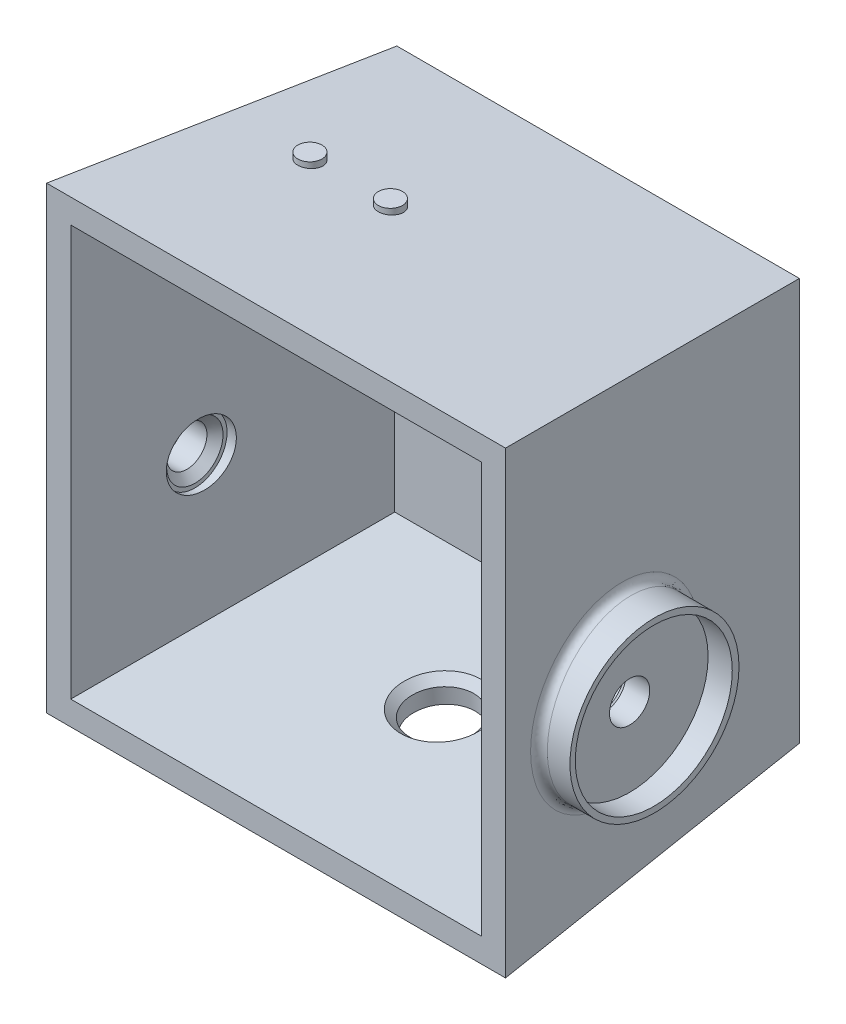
ISO-10303-21;
HEADER;
FILE_DESCRIPTION(('STEP AP214'),'2;1');
FILE_NAME('part.step','',(''),(''),'','','');
FILE_SCHEMA(('AUTOMOTIVE_DESIGN { 1 0 10303 214 1 1 1 1 }'));
ENDSEC;
DATA;
#1=APPLICATION_CONTEXT('core data for automotive mechanical design processes');
#2=APPLICATION_PROTOCOL_DEFINITION('international standard','automotive_design',2000,#1);
#3=PRODUCT_CONTEXT('',#1,'mechanical');
#4=PRODUCT('Part','Part','',(#3));
#5=PRODUCT_RELATED_PRODUCT_CATEGORY('part','',(#4));
#6=PRODUCT_DEFINITION_FORMATION('','',#4);
#7=PRODUCT_DEFINITION_CONTEXT('part definition',#1,'design');
#8=PRODUCT_DEFINITION('design','',#6,#7);
#9=PRODUCT_DEFINITION_SHAPE('','',#8);
#10=(LENGTH_UNIT() NAMED_UNIT(*) SI_UNIT(.MILLI.,.METRE.));
#11=(NAMED_UNIT(*) PLANE_ANGLE_UNIT() SI_UNIT($,.RADIAN.));
#12=(NAMED_UNIT(*) SI_UNIT($,.STERADIAN.) SOLID_ANGLE_UNIT());
#13=UNCERTAINTY_MEASURE_WITH_UNIT(LENGTH_MEASURE(1.E-05),#10,'distance_accuracy_value','');
#14=(GEOMETRIC_REPRESENTATION_CONTEXT(3) GLOBAL_UNCERTAINTY_ASSIGNED_CONTEXT((#13)) GLOBAL_UNIT_ASSIGNED_CONTEXT((#10,
#11,#12)) REPRESENTATION_CONTEXT('',''));
#15=CARTESIAN_POINT('',(0.,0.,0.));
#16=DIRECTION('',(0.,0.,1.));
#17=DIRECTION('',(1.,0.,0.));
#18=AXIS2_PLACEMENT_3D('',#15,#16,#17);
#19=CARTESIAN_POINT('',(90.,-6.,25.0871557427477));
#20=DIRECTION('',(-1.,0.,0.));
#21=DIRECTION('',(0.,0.,1.));
#22=AXIS2_PLACEMENT_3D('',#19,#20,#21);
#23=CYLINDRICAL_SURFACE('',#22,2.5);
#24=CARTESIAN_POINT('',(-25.9999999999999,-6.,25.0871557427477));
#25=DIRECTION('',(1.,0.,0.));
#26=DIRECTION('',(0.,0.,-1.));
#27=AXIS2_PLACEMENT_3D('',#24,#25,#26);
#28=CIRCLE('',#27,2.5);
#29=CARTESIAN_POINT('',(-25.9999999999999,-6.,27.5871557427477));
#30=VERTEX_POINT('',#29);
#31=EDGE_CURVE('E290',#30,#30,#28,.T.);
#32=CARTESIAN_POINT('',(-29.,-6.,25.0871557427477));
#33=DIRECTION('',(-1.,0.,0.));
#34=DIRECTION('',(0.,0.,1.));
#35=AXIS2_PLACEMENT_3D('',#32,#33,#34);
#36=CIRCLE('',#35,2.5);
#37=CARTESIAN_POINT('',(-29.,-6.,27.5871557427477));
#38=VERTEX_POINT('',#37);
#39=EDGE_CURVE('E265',#38,#38,#36,.T.);
#40=CARTESIAN_POINT('',(-25.9999999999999,-6.,27.5871557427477));
#41=CARTESIAN_POINT('',(-26.0312499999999,-6.,27.5871557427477));
#42=CARTESIAN_POINT('',(-26.0624999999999,-6.,27.5871557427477));
#43=CARTESIAN_POINT('',(-26.1249999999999,-6.,27.5871557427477));
#44=CARTESIAN_POINT('',(-26.1562499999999,-6.,27.5871557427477));
#45=CARTESIAN_POINT('',(-26.2187499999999,-6.,27.5871557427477));
#46=CARTESIAN_POINT('',(-26.25,-6.,27.5871557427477));
#47=CARTESIAN_POINT('',(-26.3125,-6.,27.5871557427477));
#48=CARTESIAN_POINT('',(-26.34375,-6.,27.5871557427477));
#49=CARTESIAN_POINT('',(-26.40625,-6.,27.5871557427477));
#50=CARTESIAN_POINT('',(-26.4374999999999,-6.,27.5871557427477));
#51=CARTESIAN_POINT('',(-26.4999999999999,-6.,27.5871557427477));
#52=CARTESIAN_POINT('',(-26.5312499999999,-6.,27.5871557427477));
#53=CARTESIAN_POINT('',(-26.5937499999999,-6.,27.5871557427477));
#54=CARTESIAN_POINT('',(-26.625,-6.,27.5871557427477));
#55=CARTESIAN_POINT('',(-26.6875,-6.,27.5871557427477));
#56=CARTESIAN_POINT('',(-26.71875,-6.,27.5871557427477));
#57=CARTESIAN_POINT('',(-26.78125,-6.,27.5871557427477));
#58=CARTESIAN_POINT('',(-26.8125,-6.,27.5871557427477));
#59=CARTESIAN_POINT('',(-26.875,-6.,27.5871557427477));
#60=CARTESIAN_POINT('',(-26.90625,-6.,27.5871557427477));
#61=CARTESIAN_POINT('',(-26.96875,-6.,27.5871557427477));
#62=CARTESIAN_POINT('',(-27.,-6.,27.5871557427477));
#63=CARTESIAN_POINT('',(-27.0625,-6.,27.5871557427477));
#64=CARTESIAN_POINT('',(-27.09375,-6.,27.5871557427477));
#65=CARTESIAN_POINT('',(-27.15625,-6.,27.5871557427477));
#66=CARTESIAN_POINT('',(-27.1875,-6.,27.5871557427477));
#67=CARTESIAN_POINT('',(-27.25,-6.,27.5871557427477));
#68=CARTESIAN_POINT('',(-27.28125,-6.,27.5871557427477));
#69=CARTESIAN_POINT('',(-27.34375,-6.,27.5871557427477));
#70=CARTESIAN_POINT('',(-27.375,-6.,27.5871557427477));
#71=CARTESIAN_POINT('',(-27.4375,-6.,27.5871557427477));
#72=CARTESIAN_POINT('',(-27.46875,-6.,27.5871557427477));
#73=CARTESIAN_POINT('',(-27.53125,-6.,27.5871557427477));
#74=CARTESIAN_POINT('',(-27.5625,-6.,27.5871557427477));
#75=CARTESIAN_POINT('',(-27.625,-6.,27.5871557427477));
#76=CARTESIAN_POINT('',(-27.65625,-6.,27.5871557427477));
#77=CARTESIAN_POINT('',(-27.71875,-6.,27.5871557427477));
#78=CARTESIAN_POINT('',(-27.75,-6.,27.5871557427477));
#79=CARTESIAN_POINT('',(-27.8125,-6.,27.5871557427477));
#80=CARTESIAN_POINT('',(-27.84375,-6.,27.5871557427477));
#81=CARTESIAN_POINT('',(-27.90625,-6.,27.5871557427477));
#82=CARTESIAN_POINT('',(-27.9375,-6.,27.5871557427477));
#83=CARTESIAN_POINT('',(-28.,-6.,27.5871557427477));
#84=CARTESIAN_POINT('',(-28.03125,-6.,27.5871557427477));
#85=CARTESIAN_POINT('',(-28.09375,-6.,27.5871557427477));
#86=CARTESIAN_POINT('',(-28.125,-6.,27.5871557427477));
#87=CARTESIAN_POINT('',(-28.1875,-6.,27.5871557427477));
#88=CARTESIAN_POINT('',(-28.21875,-6.,27.5871557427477));
#89=CARTESIAN_POINT('',(-28.28125,-6.,27.5871557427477));
#90=CARTESIAN_POINT('',(-28.3125,-6.,27.5871557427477));
#91=CARTESIAN_POINT('',(-28.375,-6.,27.5871557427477));
#92=CARTESIAN_POINT('',(-28.40625,-6.,27.5871557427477));
#93=CARTESIAN_POINT('',(-28.46875,-6.,27.5871557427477));
#94=CARTESIAN_POINT('',(-28.5,-6.,27.5871557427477));
#95=CARTESIAN_POINT('',(-28.5625,-6.,27.5871557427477));
#96=CARTESIAN_POINT('',(-28.59375,-6.,27.5871557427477));
#97=CARTESIAN_POINT('',(-28.65625,-6.,27.5871557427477));
#98=CARTESIAN_POINT('',(-28.6875,-6.,27.5871557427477));
#99=CARTESIAN_POINT('',(-28.75,-6.,27.5871557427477));
#100=CARTESIAN_POINT('',(-28.78125,-6.,27.5871557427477));
#101=CARTESIAN_POINT('',(-28.84375,-6.,27.5871557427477));
#102=CARTESIAN_POINT('',(-28.875,-6.,27.5871557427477));
#103=CARTESIAN_POINT('',(-28.9375,-6.,27.5871557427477));
#104=CARTESIAN_POINT('',(-28.96875,-6.,27.5871557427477));
#105=CARTESIAN_POINT('',(-29.,-6.,27.5871557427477));
#106=B_SPLINE_CURVE_WITH_KNOTS('',3,(#40,#41,#42,#43,#44,#45,#46,#47,#48,#49,#50,#51,#52,#53,
#54,#55,#56,#57,#58,#59,#60,#61,#62,#63,#64,#65,#66,#67,#68,#69,#70,#71,#72,#73,#74,#75,#76,#77,
#78,#79,#80,#81,#82,#83,#84,#85,#86,#87,#88,#89,#90,#91,#92,#93,#94,#95,#96,#97,#98,#99,#100,
#101,#102,#103,#104,#105),.UNSPECIFIED.,.F.,.F.,(4,2,2,2,2,2,2,2,2,2,2,2,2,2,2,2,2,2,2,2,2,2,2,
2,2,2,2,2,2,2,2,2,4),(0.,0.0937500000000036,0.187500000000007,0.281250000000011,
0.375000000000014,0.468750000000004,0.562500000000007,0.656250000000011,0.750000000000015,
0.843750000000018,0.937500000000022,1.03125000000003,1.12500000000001,1.21875000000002,
1.31250000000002,1.40625000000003,1.50000000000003,1.59375000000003,1.68750000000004,
1.78125000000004,1.87500000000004,1.96875000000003,2.06250000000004,2.15625000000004,
2.25000000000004,2.34375000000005,2.43750000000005,2.53125000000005,2.62500000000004,
2.71875000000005,2.81250000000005,2.90625000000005,3.00000000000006),.UNSPECIFIED.);
#107=EDGE_CURVE('BSEAM37',#30,#38,#106,.T.);
#108=ORIENTED_EDGE('',*,*,#31,.T.);
#109=ORIENTED_EDGE('',*,*,#39,.T.);
#110=ORIENTED_EDGE('',*,*,#107,.T.);
#111=ORIENTED_EDGE('',*,*,#107,.F.);
#112=EDGE_LOOP('',(#108,#110,#109,#111));
#113=FACE_BOUND('',#112,.T.);
#114=ADVANCED_FACE('F37',(#113),#23,.F.);
#115=CARTESIAN_POINT('',(-25.,25.,0.));
#116=DIRECTION('',(-0.996194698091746,0.,-0.0871557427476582));
#117=DIRECTION('',(-0.0871557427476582,0.,0.996194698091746));
#118=AXIS2_PLACEMENT_3D('',#115,#116,#117);
#119=PLANE('',#118);
#120=CARTESIAN_POINT('',(-27.1948417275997,-6.,25.0871557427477));
#121=DIRECTION('',(-0.996194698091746,0.,-0.0871557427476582));
#122=DIRECTION('',(0.0871557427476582,0.,-0.996194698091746));
#123=AXIS2_PLACEMENT_3D('',#120,#121,#122);
#124=ELLIPSE('',#123,11.5439281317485,11.5);
#125=CARTESIAN_POINT('',(-26.1887220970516,-6.00000000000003,13.5871557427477));
#126=VERTEX_POINT('',#125);
#127=EDGE_CURVE('E162',#126,#126,#124,.F.);
#128=ORIENTED_EDGE('',*,*,#127,.T.);
#129=EDGE_LOOP('',(#128));
#130=FACE_BOUND('',#129,.T.);
#131=DIRECTION('',(0.,-1.,0.));
#132=VECTOR('',#131,1.);
#133=CARTESIAN_POINT('',(-25.,25.,0.));
#134=LINE('',#133,#132);
#135=CARTESIAN_POINT('',(-25.,25.,0.));
#136=VERTEX_POINT('',#135);
#137=CARTESIAN_POINT('',(-25.,-25.,0.));
#138=VERTEX_POINT('',#137);
#139=EDGE_CURVE('E149',#136,#138,#134,.T.);
#140=ORIENTED_EDGE('',*,*,#139,.T.);
#141=DIRECTION('',(0.0868265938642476,0.0868265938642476,-0.992432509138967));
#142=VECTOR('',#141,1.);
#143=CARTESIAN_POINT('',(-25.,-25.,0.));
#144=LINE('',#143,#142);
#145=CARTESIAN_POINT('',(-28.499546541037,-28.499546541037,40.));
#146=VERTEX_POINT('',#145);
#147=EDGE_CURVE('E159',#146,#138,#144,.T.);
#148=ORIENTED_EDGE('',*,*,#147,.F.);
#149=DIRECTION('',(0.,1.,0.));
#150=VECTOR('',#149,1.);
#151=CARTESIAN_POINT('',(-28.499546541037,25.,40.));
#152=LINE('',#151,#150);
#153=CARTESIAN_POINT('',(-28.499546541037,28.499546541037,40.));
#154=VERTEX_POINT('',#153);
#155=EDGE_CURVE('E158',#154,#146,#152,.F.);
#156=ORIENTED_EDGE('',*,*,#155,.F.);
#157=DIRECTION('',(0.0868265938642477,-0.0868265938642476,-0.992432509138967));
#158=VECTOR('',#157,1.);
#159=CARTESIAN_POINT('',(-25.,25.,0.));
#160=LINE('',#159,#158);
#161=EDGE_CURVE('E164',#154,#136,#160,.T.);
#162=ORIENTED_EDGE('',*,*,#161,.T.);
#163=EDGE_LOOP('',(#140,#148,#156,#162));
#164=FACE_BOUND('',#163,.T.);
#165=ADVANCED_FACE('F207',(#130,#164),#119,.T.);
#166=CARTESIAN_POINT('',(-25.,-25.,0.));
#167=DIRECTION('',(0.,-0.996194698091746,-0.0871557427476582));
#168=DIRECTION('',(0.,0.0871557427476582,-0.996194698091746));
#169=AXIS2_PLACEMENT_3D('',#166,#167,#168);
#170=PLANE('',#169);
#171=CARTESIAN_POINT('',(0.0778915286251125,-26.690252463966,19.3196740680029));
#172=DIRECTION('',(0.,-0.996194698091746,-0.0871557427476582));
#173=DIRECTION('',(0.,0.0871557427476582,-0.996194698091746));
#174=AXIS2_PLACEMENT_3D('',#171,#172,#173);
#175=CIRCLE('',#174,4.00000000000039);
#176=CARTESIAN_POINT('',(0.0778915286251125,-26.3416294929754,15.3348952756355));
#177=VERTEX_POINT('',#176);
#178=EDGE_CURVE('E308',#177,#177,#175,.T.);
#179=ORIENTED_EDGE('',*,*,#178,.F.);
#180=EDGE_LOOP('',(#179));
#181=FACE_BOUND('',#180,.T.);
#182=DIRECTION('',(1.,0.,0.));
#183=VECTOR('',#182,1.);
#184=CARTESIAN_POINT('',(-25.,-25.,0.));
#185=LINE('',#184,#183);
#186=CARTESIAN_POINT('',(25.,-25.,0.));
#187=VERTEX_POINT('',#186);
#188=EDGE_CURVE('E152',#138,#187,#185,.T.);
#189=ORIENTED_EDGE('',*,*,#188,.T.);
#190=DIRECTION('',(-0.0868265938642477,0.0868265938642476,-0.992432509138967));
#191=VECTOR('',#190,1.);
#192=CARTESIAN_POINT('',(24.6230571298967,-24.6230571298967,-4.30847672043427));
#193=LINE('',#192,#191);
#194=CARTESIAN_POINT('',(28.499546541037,-28.499546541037,40.));
#195=VERTEX_POINT('',#194);
#196=EDGE_CURVE('E163',#195,#187,#193,.T.);
#197=ORIENTED_EDGE('',*,*,#196,.F.);
#198=DIRECTION('',(-1.,0.,0.));
#199=VECTOR('',#198,1.);
#200=CARTESIAN_POINT('',(-25.,-28.499546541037,40.));
#201=LINE('',#200,#199);
#202=EDGE_CURVE('E173',#146,#195,#201,.F.);
#203=ORIENTED_EDGE('',*,*,#202,.F.);
#204=ORIENTED_EDGE('',*,*,#147,.T.);
#205=EDGE_LOOP('',(#189,#197,#203,#204));
#206=FACE_BOUND('',#205,.T.);
#207=ADVANCED_FACE('F204',(#181,#206),#170,.T.);
#208=CARTESIAN_POINT('',(25.,25.,0.));
#209=DIRECTION('',(0.996194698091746,0.,-0.0871557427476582));
#210=DIRECTION('',(-0.0871557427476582,0.,-0.996194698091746));
#211=AXIS2_PLACEMENT_3D('',#208,#209,#210);
#212=PLANE('',#211);
#213=CARTESIAN_POINT('',(27.1948417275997,-6.,25.0871557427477));
#214=DIRECTION('',(0.996194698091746,0.,-0.0871557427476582));
#215=DIRECTION('',(0.0871557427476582,0.,0.996194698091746));
#216=AXIS2_PLACEMENT_3D('',#213,#214,#215);
#217=ELLIPSE('',#216,11.5439281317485,11.5);
#218=CARTESIAN_POINT('',(28.2009613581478,-6.00000000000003,36.5871557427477));
#219=VERTEX_POINT('',#218);
#220=EDGE_CURVE('E183',#219,#219,#217,.F.);
#221=ORIENTED_EDGE('',*,*,#220,.T.);
#222=EDGE_LOOP('',(#221));
#223=FACE_BOUND('',#222,.T.);
#224=DIRECTION('',(0.,1.,0.));
#225=VECTOR('',#224,1.);
#226=CARTESIAN_POINT('',(25.,25.,0.));
#227=LINE('',#226,#225);
#228=CARTESIAN_POINT('',(25.,25.,0.));
#229=VERTEX_POINT('',#228);
#230=EDGE_CURVE('E154',#187,#229,#227,.T.);
#231=ORIENTED_EDGE('',*,*,#230,.T.);
#232=DIRECTION('',(-0.0868265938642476,-0.0868265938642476,-0.992432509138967));
#233=VECTOR('',#232,1.);
#234=CARTESIAN_POINT('',(24.6230571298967,24.6230571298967,-4.30847672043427));
#235=LINE('',#234,#233);
#236=CARTESIAN_POINT('',(28.499546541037,28.499546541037,40.));
#237=VERTEX_POINT('',#236);
#238=EDGE_CURVE('E167',#237,#229,#235,.T.);
#239=ORIENTED_EDGE('',*,*,#238,.F.);
#240=DIRECTION('',(0.,-1.,0.));
#241=VECTOR('',#240,1.);
#242=CARTESIAN_POINT('',(28.499546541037,25.,40.));
#243=LINE('',#242,#241);
#244=EDGE_CURVE('E175',#195,#237,#243,.F.);
#245=ORIENTED_EDGE('',*,*,#244,.F.);
#246=ORIENTED_EDGE('',*,*,#196,.T.);
#247=EDGE_LOOP('',(#231,#239,#245,#246));
#248=FACE_BOUND('',#247,.T.);
#249=ADVANCED_FACE('F347',(#223,#248),#212,.T.);
#250=CARTESIAN_POINT('',(-25.,25.,0.));
#251=DIRECTION('',(0.,0.996194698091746,-0.0871557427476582));
#252=DIRECTION('',(0.,0.0871557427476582,0.996194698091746));
#253=AXIS2_PLACEMENT_3D('',#250,#251,#252);
#254=PLANE('',#253);
#255=CARTESIAN_POINT('',(-6.50045345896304,26.6885312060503,19.3));
#256=DIRECTION('',(0.,0.996194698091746,-0.0871557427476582));
#257=DIRECTION('',(0.,0.0871557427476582,0.996194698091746));
#258=AXIS2_PLACEMENT_3D('',#255,#256,#257);
#259=ELLIPSE('',#258,1.50572975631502,1.5);
#260=CARTESIAN_POINT('',(-6.50045345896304,26.8197642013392,20.8));
#261=VERTEX_POINT('',#260);
#262=EDGE_CURVE('E189',#261,#261,#259,.T.);
#263=ORIENTED_EDGE('',*,*,#262,.F.);
#264=EDGE_LOOP('',(#263));
#265=FACE_BOUND('',#264,.T.);
#266=CARTESIAN_POINT('',(-16.500453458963,26.6885312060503,19.3));
#267=DIRECTION('',(0.,0.996194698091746,-0.0871557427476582));
#268=DIRECTION('',(0.,-0.0871557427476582,-0.996194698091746));
#269=AXIS2_PLACEMENT_3D('',#266,#267,#268);
#270=ELLIPSE('',#269,1.50572975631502,1.5);
#271=CARTESIAN_POINT('',(-16.500453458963,26.5572982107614,17.8));
#272=VERTEX_POINT('',#271);
#273=EDGE_CURVE('E270',#272,#272,#270,.F.);
#274=ORIENTED_EDGE('',*,*,#273,.T.);
#275=EDGE_LOOP('',(#274));
#276=FACE_BOUND('',#275,.T.);
#277=DIRECTION('',(-1.,0.,0.));
#278=VECTOR('',#277,1.);
#279=CARTESIAN_POINT('',(-25.,25.,0.));
#280=LINE('',#279,#278);
#281=EDGE_CURVE('E156',#229,#136,#280,.T.);
#282=ORIENTED_EDGE('',*,*,#281,.T.);
#283=ORIENTED_EDGE('',*,*,#161,.F.);
#284=DIRECTION('',(1.,0.,0.));
#285=VECTOR('',#284,1.);
#286=CARTESIAN_POINT('',(-25.,28.499546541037,40.));
#287=LINE('',#286,#285);
#288=EDGE_CURVE('E61',#237,#154,#287,.F.);
#289=ORIENTED_EDGE('',*,*,#288,.F.);
#290=ORIENTED_EDGE('',*,*,#238,.T.);
#291=EDGE_LOOP('',(#282,#283,#289,#290));
#292=FACE_BOUND('',#291,.T.);
#293=ADVANCED_FACE('F223',(#265,#276,#292),#254,.T.);
#294=CARTESIAN_POINT('',(0.,0.,40.));
#295=DIRECTION('',(0.,0.,1.));
#296=DIRECTION('',(1.,0.,0.));
#297=AXIS2_PLACEMENT_3D('',#294,#295,#296);
#298=PLANE('',#297);
#299=DIRECTION('',(0.,-1.,0.));
#300=VECTOR('',#299,1.);
#301=CARTESIAN_POINT('',(-25.5,25.5,40.));
#302=LINE('',#301,#300);
#303=CARTESIAN_POINT('',(-25.5,25.5,40.));
#304=VERTEX_POINT('',#303);
#305=CARTESIAN_POINT('',(-25.5,-25.5,40.));
#306=VERTEX_POINT('',#305);
#307=EDGE_CURVE('E53',#304,#306,#302,.T.);
#308=ORIENTED_EDGE('',*,*,#307,.F.);
#309=DIRECTION('',(-1.,0.,0.));
#310=VECTOR('',#309,1.);
#311=CARTESIAN_POINT('',(-25.5,25.5,40.));
#312=LINE('',#311,#310);
#313=CARTESIAN_POINT('',(25.5,25.5,40.));
#314=VERTEX_POINT('',#313);
#315=EDGE_CURVE('E125',#314,#304,#312,.T.);
#316=ORIENTED_EDGE('',*,*,#315,.F.);
#317=DIRECTION('',(0.,1.,0.));
#318=VECTOR('',#317,1.);
#319=CARTESIAN_POINT('',(25.5,25.5,40.));
#320=LINE('',#319,#318);
#321=CARTESIAN_POINT('',(25.5,-25.5,40.));
#322=VERTEX_POINT('',#321);
#323=EDGE_CURVE('E108',#322,#314,#320,.T.);
#324=ORIENTED_EDGE('',*,*,#323,.F.);
#325=DIRECTION('',(1.,0.,0.));
#326=VECTOR('',#325,1.);
#327=CARTESIAN_POINT('',(-25.5,-25.5,40.));
#328=LINE('',#327,#326);
#329=EDGE_CURVE('E119',#306,#322,#328,.T.);
#330=ORIENTED_EDGE('',*,*,#329,.F.);
#331=EDGE_LOOP('',(#308,#316,#324,#330));
#332=FACE_BOUND('',#331,.T.);
#333=ORIENTED_EDGE('',*,*,#155,.T.);
#334=ORIENTED_EDGE('',*,*,#202,.T.);
#335=ORIENTED_EDGE('',*,*,#244,.T.);
#336=ORIENTED_EDGE('',*,*,#288,.T.);
#337=EDGE_LOOP('',(#333,#334,#335,#336));
#338=FACE_BOUND('',#337,.T.);
#339=ADVANCED_FACE('F123',(#332,#338),#298,.T.);
#340=CARTESIAN_POINT('',(0.,0.,0.));
#341=DIRECTION('',(0.,0.,1.));
#342=DIRECTION('',(1.,0.,0.));
#343=AXIS2_PLACEMENT_3D('',#340,#341,#342);
#344=PLANE('',#343);
#345=ORIENTED_EDGE('',*,*,#139,.F.);
#346=ORIENTED_EDGE('',*,*,#281,.F.);
#347=ORIENTED_EDGE('',*,*,#230,.F.);
#348=ORIENTED_EDGE('',*,*,#188,.F.);
#349=EDGE_LOOP('',(#345,#346,#347,#348));
#350=FACE_BOUND('',#349,.T.);
#351=ADVANCED_FACE('F222',(#350),#344,.F.);
#352=CARTESIAN_POINT('',(32.,-6.,25.));
#353=DIRECTION('',(1.,0.,0.));
#354=DIRECTION('',(0.,0.,-1.));
#355=AXIS2_PLACEMENT_3D('',#352,#353,#354);
#356=PLANE('',#355);
#357=CARTESIAN_POINT('',(32.,-6.,25.0871557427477));
#358=DIRECTION('',(1.,0.,0.));
#359=DIRECTION('',(0.,0.,-1.));
#360=AXIS2_PLACEMENT_3D('',#357,#358,#359);
#361=CIRCLE('',#360,9.75);
#362=CARTESIAN_POINT('',(32.,-6.,15.3371557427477));
#363=VERTEX_POINT('',#362);
#364=EDGE_CURVE('E325',#363,#363,#361,.T.);
#365=ORIENTED_EDGE('',*,*,#364,.F.);
#366=EDGE_LOOP('',(#365));
#367=FACE_BOUND('',#366,.T.);
#368=CARTESIAN_POINT('',(32.,-6.,25.));
#369=DIRECTION('',(1.,0.,0.));
#370=DIRECTION('',(0.,0.,-1.));
#371=AXIS2_PLACEMENT_3D('',#368,#369,#370);
#372=CIRCLE('',#371,10.5);
#373=CARTESIAN_POINT('',(32.,-6.,14.5));
#374=VERTEX_POINT('',#373);
#375=EDGE_CURVE('E133',#374,#374,#372,.T.);
#376=ORIENTED_EDGE('',*,*,#375,.T.);
#377=EDGE_LOOP('',(#376));
#378=FACE_BOUND('',#377,.T.);
#379=ADVANCED_FACE('F225',(#367,#378),#356,.T.);
#380=CARTESIAN_POINT('',(-32.,-6.,25.));
#381=DIRECTION('',(1.,0.,0.));
#382=DIRECTION('',(0.,0.,-1.));
#383=AXIS2_PLACEMENT_3D('',#380,#381,#382);
#384=CYLINDRICAL_SURFACE('',#383,10.5);
#385=CARTESIAN_POINT('',(28.1910364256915,-6.,25.));
#386=DIRECTION('',(-0.995440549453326,0.,0.0953840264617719));
#387=DIRECTION('',(0.0953840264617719,0.,0.995440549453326));
#388=AXIS2_PLACEMENT_3D('',#385,#386,#387);
#389=ELLIPSE('',#388,10.5480935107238,10.5);
#390=CARTESIAN_POINT('',(29.1971560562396,-6.00000000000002,35.5));
#391=VERTEX_POINT('',#390);
#392=EDGE_CURVE('E186',#391,#391,#389,.F.);
#393=ORIENTED_EDGE('',*,*,#392,.T.);
#394=EDGE_LOOP('',(#393));
#395=FACE_BOUND('',#394,.T.);
#396=ORIENTED_EDGE('',*,*,#375,.F.);
#397=EDGE_LOOP('',(#396));
#398=FACE_BOUND('',#397,.T.);
#399=ADVANCED_FACE('F217',(#395,#398),#384,.T.);
#400=CARTESIAN_POINT('',(-28.1910364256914,-6.,25.));
#401=DIRECTION('',(0.995440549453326,0.,0.0953840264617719));
#402=DIRECTION('',(0.0953840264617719,0.,-0.995440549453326));
#403=AXIS2_PLACEMENT_3D('',#400,#401,#402);
#404=ELLIPSE('',#403,10.5480935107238,10.5);
#405=CARTESIAN_POINT('',(-27.1849167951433,-6.00000000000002,14.5));
#406=VERTEX_POINT('',#405);
#407=EDGE_CURVE('E180',#406,#406,#404,.F.);
#408=ORIENTED_EDGE('',*,*,#407,.T.);
#409=EDGE_LOOP('',(#408));
#410=FACE_BOUND('',#409,.T.);
#411=CARTESIAN_POINT('',(-32.,-6.,25.));
#412=DIRECTION('',(1.,0.,0.));
#413=DIRECTION('',(0.,0.,-1.));
#414=AXIS2_PLACEMENT_3D('',#411,#412,#413);
#415=CIRCLE('',#414,10.5);
#416=CARTESIAN_POINT('',(-32.,-6.,14.5));
#417=VERTEX_POINT('',#416);
#418=EDGE_CURVE('E146',#417,#417,#415,.T.);
#419=ORIENTED_EDGE('',*,*,#418,.T.);
#420=EDGE_LOOP('',(#419));
#421=FACE_BOUND('',#420,.T.);
#422=ADVANCED_FACE('F211',(#410,#421),#384,.T.);
#423=CARTESIAN_POINT('',(-32.,-6.,25.));
#424=DIRECTION('',(1.,0.,0.));
#425=DIRECTION('',(0.,0.,-1.));
#426=AXIS2_PLACEMENT_3D('',#423,#424,#425);
#427=PLANE('',#426);
#428=CARTESIAN_POINT('',(-32.,-6.,25.0871557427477));
#429=DIRECTION('',(-1.,0.,0.));
#430=DIRECTION('',(0.,0.,1.));
#431=AXIS2_PLACEMENT_3D('',#428,#429,#430);
#432=CIRCLE('',#431,9.75);
#433=CARTESIAN_POINT('',(-32.,-6.,34.8371557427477));
#434=VERTEX_POINT('',#433);
#435=EDGE_CURVE('E264',#434,#434,#432,.T.);
#436=ORIENTED_EDGE('',*,*,#435,.F.);
#437=EDGE_LOOP('',(#436));
#438=FACE_BOUND('',#437,.T.);
#439=ORIENTED_EDGE('',*,*,#418,.F.);
#440=EDGE_LOOP('',(#439));
#441=FACE_BOUND('',#440,.T.);
#442=ADVANCED_FACE('F216',(#438,#441),#427,.F.);
#443=CARTESIAN_POINT('',(-25.5,25.5,40.));
#444=DIRECTION('',(-0.996194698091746,0.,-0.0871557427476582));
#445=DIRECTION('',(-0.0871557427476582,0.,0.996194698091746));
#446=AXIS2_PLACEMENT_3D('',#443,#444,#445);
#447=PLANE('',#446);
#448=CARTESIAN_POINT('',(-24.1952951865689,-5.9999999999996,25.0871557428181));
#449=DIRECTION('',(-0.996194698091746,0.,-0.0871557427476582));
#450=DIRECTION('',(-0.0871557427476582,0.,0.996194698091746));
#451=AXIS2_PLACEMENT_3D('',#448,#449,#450);
#452=ELLIPSE('',#451,4.01527935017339,4.);
#453=CARTESIAN_POINT('',(-24.5452498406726,-5.9999999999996,29.0871557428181));
#454=VERTEX_POINT('',#453);
#455=EDGE_CURVE('E281',#454,#454,#452,.F.);
#456=ORIENTED_EDGE('',*,*,#455,.F.);
#457=EDGE_LOOP('',(#456));
#458=FACE_BOUND('',#457,.T.);
#459=ORIENTED_EDGE('',*,*,#307,.T.);
#460=DIRECTION('',(-0.0868265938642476,-0.0868265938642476,0.992432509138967));
#461=VECTOR('',#460,1.);
#462=CARTESIAN_POINT('',(-25.1155182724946,-25.1155182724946,35.6053537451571));
#463=LINE('',#462,#461);
#464=CARTESIAN_POINT('',(-22.2629194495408,-22.2629194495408,3.));
#465=VERTEX_POINT('',#464);
#466=EDGE_CURVE('E116',#465,#306,#463,.T.);
#467=ORIENTED_EDGE('',*,*,#466,.F.);
#468=DIRECTION('',(0.,-1.,0.));
#469=VECTOR('',#468,1.);
#470=CARTESIAN_POINT('',(-22.2629194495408,0.,3.));
#471=LINE('',#470,#469);
#472=CARTESIAN_POINT('',(-22.2629194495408,22.2629194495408,3.));
#473=VERTEX_POINT('',#472);
#474=EDGE_CURVE('E127',#473,#465,#471,.T.);
#475=ORIENTED_EDGE('',*,*,#474,.F.);
#476=DIRECTION('',(-0.0868265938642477,0.0868265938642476,0.992432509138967));
#477=VECTOR('',#476,1.);
#478=CARTESIAN_POINT('',(-25.5,25.5,40.));
#479=LINE('',#478,#477);
#480=EDGE_CURVE('E131',#473,#304,#479,.T.);
#481=ORIENTED_EDGE('',*,*,#480,.T.);
#482=EDGE_LOOP('',(#459,#467,#475,#481));
#483=FACE_BOUND('',#482,.T.);
#484=ADVANCED_FACE('F491',(#458,#483),#447,.F.);
#485=CARTESIAN_POINT('',(-25.5,25.5,40.));
#486=DIRECTION('',(0.,0.996194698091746,-0.0871557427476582));
#487=DIRECTION('',(0.,0.0871557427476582,0.996194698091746));
#488=AXIS2_PLACEMENT_3D('',#485,#486,#487);
#489=PLANE('',#488);
#490=ORIENTED_EDGE('',*,*,#315,.T.);
#491=ORIENTED_EDGE('',*,*,#480,.F.);
#492=DIRECTION('',(-1.,0.,0.));
#493=VECTOR('',#492,1.);
#494=CARTESIAN_POINT('',(0.,22.2629194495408,3.));
#495=LINE('',#494,#493);
#496=CARTESIAN_POINT('',(22.2629194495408,22.2629194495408,3.));
#497=VERTEX_POINT('',#496);
#498=EDGE_CURVE('E134',#497,#473,#495,.T.);
#499=ORIENTED_EDGE('',*,*,#498,.F.);
#500=DIRECTION('',(0.0868265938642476,0.0868265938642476,0.992432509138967));
#501=VECTOR('',#500,1.);
#502=CARTESIAN_POINT('',(25.5,25.5,40.));
#503=LINE('',#502,#501);
#504=EDGE_CURVE('E115',#497,#314,#503,.T.);
#505=ORIENTED_EDGE('',*,*,#504,.T.);
#506=EDGE_LOOP('',(#490,#491,#499,#505));
#507=FACE_BOUND('',#506,.T.);
#508=ADVANCED_FACE('F556',(#507),#489,.F.);
#509=CARTESIAN_POINT('',(25.5,25.5,40.));
#510=DIRECTION('',(0.996194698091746,0.,-0.0871557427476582));
#511=DIRECTION('',(-0.0871557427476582,0.,-0.996194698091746));
#512=AXIS2_PLACEMENT_3D('',#509,#510,#511);
#513=PLANE('',#512);
#514=CARTESIAN_POINT('',(24.1952951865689,-5.9999999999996,25.0871557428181));
#515=DIRECTION('',(0.996194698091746,0.,-0.0871557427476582));
#516=DIRECTION('',(-0.0871557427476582,0.,-0.996194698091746));
#517=AXIS2_PLACEMENT_3D('',#514,#515,#516);
#518=ELLIPSE('',#517,4.01527935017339,4.);
#519=CARTESIAN_POINT('',(23.8453405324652,-5.9999999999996,21.0871557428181));
#520=VERTEX_POINT('',#519);
#521=EDGE_CURVE('E278',#520,#520,#518,.F.);
#522=ORIENTED_EDGE('',*,*,#521,.F.);
#523=EDGE_LOOP('',(#522));
#524=FACE_BOUND('',#523,.T.);
#525=ORIENTED_EDGE('',*,*,#323,.T.);
#526=ORIENTED_EDGE('',*,*,#504,.F.);
#527=DIRECTION('',(0.,1.,0.));
#528=VECTOR('',#527,1.);
#529=CARTESIAN_POINT('',(22.2629194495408,0.,3.));
#530=LINE('',#529,#528);
#531=CARTESIAN_POINT('',(22.2629194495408,-22.2629194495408,3.));
#532=VERTEX_POINT('',#531);
#533=EDGE_CURVE('E111',#532,#497,#530,.T.);
#534=ORIENTED_EDGE('',*,*,#533,.F.);
#535=DIRECTION('',(0.0868265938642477,-0.0868265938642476,0.992432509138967));
#536=VECTOR('',#535,1.);
#537=CARTESIAN_POINT('',(25.1155182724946,-25.1155182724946,35.605353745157));
#538=LINE('',#537,#536);
#539=EDGE_CURVE('E104',#532,#322,#538,.T.);
#540=ORIENTED_EDGE('',*,*,#539,.T.);
#541=EDGE_LOOP('',(#525,#526,#534,#540));
#542=FACE_BOUND('',#541,.T.);
#543=ADVANCED_FACE('F106',(#524,#542),#513,.F.);
#544=CARTESIAN_POINT('',(-25.5,-25.5,40.));
#545=DIRECTION('',(0.,-0.996194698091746,-0.0871557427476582));
#546=DIRECTION('',(0.,0.0871557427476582,-0.996194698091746));
#547=AXIS2_PLACEMENT_3D('',#544,#545,#546);
#548=PLANE('',#547);
#549=CARTESIAN_POINT('',(0.0778915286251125,-23.7134908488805,19.580106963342));
#550=DIRECTION('',(0.,-0.996194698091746,-0.0871557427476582));
#551=DIRECTION('',(0.,0.0871557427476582,-0.996194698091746));
#552=AXIS2_PLACEMENT_3D('',#549,#550,#551);
#553=CIRCLE('',#552,5.00000000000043);
#554=CARTESIAN_POINT('',(0.0778915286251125,-23.2777121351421,14.5991334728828));
#555=VERTEX_POINT('',#554);
#556=EDGE_CURVE('E46',#555,#555,#553,.T.);
#557=ORIENTED_EDGE('',*,*,#556,.T.);
#558=EDGE_LOOP('',(#557));
#559=FACE_BOUND('',#558,.T.);
#560=ORIENTED_EDGE('',*,*,#329,.T.);
#561=ORIENTED_EDGE('',*,*,#539,.F.);
#562=DIRECTION('',(1.,0.,0.));
#563=VECTOR('',#562,1.);
#564=CARTESIAN_POINT('',(0.,-22.2629194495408,3.));
#565=LINE('',#564,#563);
#566=EDGE_CURVE('E139',#465,#532,#565,.T.);
#567=ORIENTED_EDGE('',*,*,#566,.F.);
#568=ORIENTED_EDGE('',*,*,#466,.T.);
#569=EDGE_LOOP('',(#560,#561,#567,#568));
#570=FACE_BOUND('',#569,.T.);
#571=ADVANCED_FACE('F120',(#559,#570),#548,.F.);
#572=CARTESIAN_POINT('',(0.,0.,3.));
#573=DIRECTION('',(0.,0.,1.));
#574=DIRECTION('',(1.,0.,0.));
#575=AXIS2_PLACEMENT_3D('',#572,#573,#574);
#576=PLANE('',#575);
#577=ORIENTED_EDGE('',*,*,#474,.T.);
#578=ORIENTED_EDGE('',*,*,#566,.T.);
#579=ORIENTED_EDGE('',*,*,#533,.T.);
#580=ORIENTED_EDGE('',*,*,#498,.T.);
#581=EDGE_LOOP('',(#577,#578,#579,#580));
#582=FACE_BOUND('',#581,.T.);
#583=ADVANCED_FACE('F202',(#582),#576,.T.);
#584=CARTESIAN_POINT('',(-27.1849167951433,-6.00000000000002,14.5));
#585=CARTESIAN_POINT('',(-26.2685856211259,-6.00000000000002,14.5));
#586=CARTESIAN_POINT('',(-26.1887220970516,-6.00000000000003,13.5871557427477));
#587=CARTESIAN_POINT('',(-27.1849167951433,-6.45815810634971,14.5));
#588=CARTESIAN_POINT('',(-26.2685856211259,-6.46165567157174,14.5));
#589=CARTESIAN_POINT('',(-26.1887220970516,-6.50179221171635,13.5871557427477));
#590=CARTESIAN_POINT('',(-27.187794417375,-6.9163162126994,14.5300312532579));
#591=CARTESIAN_POINT('',(-26.2712545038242,-6.92341719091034,14.530505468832));
#592=CARTESIAN_POINT('',(-26.1915997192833,-7.00358442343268,13.6200471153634));
#593=CARTESIAN_POINT('',(-27.1992548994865,-7.82479254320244,14.6496343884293));
#594=CARTESIAN_POINT('',(-26.2818770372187,-7.83866449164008,14.6519215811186));
#595=CARTESIAN_POINT('',(-26.2030602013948,-7.99858230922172,13.7510410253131));
#596=CARTESIAN_POINT('',(-27.2078384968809,-8.27510974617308,14.7392139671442));
#597=CARTESIAN_POINT('',(-26.2898362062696,-8.29235378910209,14.742895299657));
#598=CARTESIAN_POINT('',(-26.2116437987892,-8.49178686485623,13.849151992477));
#599=CARTESIAN_POINT('',(-27.2305633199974,-9.16020067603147,14.9763732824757));
#600=CARTESIAN_POINT('',(-26.3108926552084,-9.18355602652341,14.9835716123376));
#601=CARTESIAN_POINT('',(-26.2343686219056,-9.46117216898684,14.1088979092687));
#602=CARTESIAN_POINT('',(-27.2447059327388,-9.59497049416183,15.1239674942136));
#603=CARTESIAN_POINT('',(-26.324000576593,-9.62124857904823,15.1333958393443));
#604=CARTESIAN_POINT('',(-26.248511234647,-9.93734863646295,14.2705487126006));
#605=CARTESIAN_POINT('',(-27.2783061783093,-10.4415309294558,15.4746241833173));
#606=CARTESIAN_POINT('',(-26.3551172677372,-10.4728630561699,15.4890612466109));
#607=CARTESIAN_POINT('',(-26.2821114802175,-10.8645338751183,14.6546012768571));
#608=CARTESIAN_POINT('',(-27.2977656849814,-10.8533133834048,15.6777062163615));
#609=CARTESIAN_POINT('',(-26.3731410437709,-10.8869268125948,15.6950739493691));
#610=CARTESIAN_POINT('',(-26.3015709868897,-11.3155337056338,14.8770244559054));
#611=CARTESIAN_POINT('',(-27.341666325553,-11.6468579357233,16.135859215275));
#612=CARTESIAN_POINT('',(-26.4137663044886,-11.6841318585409,16.1594228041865));
#613=CARTESIAN_POINT('',(-26.3454716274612,-12.1846539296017,15.3788110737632));
#614=CARTESIAN_POINT('',(-27.3661096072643,-12.0286069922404,16.3909525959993));
#615=CARTESIAN_POINT('',(-26.4363860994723,-12.0673662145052,16.4179682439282));
#616=CARTESIAN_POINT('',(-26.3699149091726,-12.6027600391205,15.6581990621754));
#617=CARTESIAN_POINT('',(-27.4195593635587,-12.7555579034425,16.9487614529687));
#618=CARTESIAN_POINT('',(-26.4858006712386,-12.7963297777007,16.9827793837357));
#619=CARTESIAN_POINT('',(-26.4233646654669,-13.398944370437,16.2691325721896));
#620=CARTESIAN_POINT('',(-27.4485680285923,-13.1007420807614,17.2514997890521));
#621=CARTESIAN_POINT('',(-26.5126157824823,-13.1420959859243,17.2892775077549));
#622=CARTESIAN_POINT('',(-26.4523733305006,-13.7770032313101,16.6007031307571));
#623=CARTESIAN_POINT('',(-27.5106522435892,-13.7486615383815,17.8994190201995));
#624=CARTESIAN_POINT('',(-26.5699463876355,-13.7902248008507,17.9445693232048));
#625=CARTESIAN_POINT('',(-26.5144575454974,-14.4866293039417,17.3103289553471));
#626=CARTESIAN_POINT('',(-27.5437298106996,-14.0513756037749,18.2446209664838));
#627=CARTESIAN_POINT('',(-26.6004828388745,-14.0925652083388,18.2936025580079));
#628=CARTESIAN_POINT('',(-26.5475351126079,-14.8181732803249,17.688407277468));
#629=CARTESIAN_POINT('',(-27.6133861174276,-14.6091784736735,18.971563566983));
#630=CARTESIAN_POINT('',(-26.6647186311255,-14.6487295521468,19.0278210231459));
#631=CARTESIAN_POINT('',(-26.6171914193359,-15.429100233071,18.4845825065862));
#632=CARTESIAN_POINT('',(-27.6499665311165,-14.864244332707,19.3533216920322));
#633=CARTESIAN_POINT('',(-26.6984381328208,-14.9024732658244,19.4132366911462));
#634=CARTESIAN_POINT('',(-26.6537718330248,-15.7084580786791,18.9026985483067));
#635=CARTESIAN_POINT('',(-27.7260030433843,-15.3223876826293,20.1468489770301));
#636=CARTESIAN_POINT('',(-26.7684496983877,-15.3572027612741,20.213472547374));
#637=CARTESIAN_POINT('',(-26.7298083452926,-16.210234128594,19.7717998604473));
#638=CARTESIAN_POINT('',(-27.7654603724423,-15.5254427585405,20.5586309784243));
#639=CARTESIAN_POINT('',(-26.8047597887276,-15.5580556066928,20.6284987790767));
#640=CARTESIAN_POINT('',(-26.7692656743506,-16.4326277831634,20.2227991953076));
#641=CARTESIAN_POINT('',(-27.8465760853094,-15.8760889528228,21.4051654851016));
#642=CARTESIAN_POINT('',(-26.8793203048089,-15.9037020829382,21.4807293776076));
#643=CARTESIAN_POINT('',(-26.8503813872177,-16.8166688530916,21.1499560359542));
#644=CARTESIAN_POINT('',(-27.8882352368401,-16.0236605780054,21.8399260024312));
#645=CARTESIAN_POINT('',(-26.9175854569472,-16.048319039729,21.9181020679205));
#646=CARTESIAN_POINT('',(-26.8920405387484,-16.9782949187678,21.626122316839));
#647=CARTESIAN_POINT('',(-27.9730422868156,-16.2608111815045,22.7249838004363));
#648=CARTESIAN_POINT('',(-26.9953935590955,-16.2791831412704,22.807452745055));
#649=CARTESIAN_POINT('',(-26.9768475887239,-17.2380312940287,22.5954713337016));
#650=CARTESIAN_POINT('',(-28.016190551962,-16.3503757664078,23.1752849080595));
#651=CARTESIAN_POINT('',(-27.0349470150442,-16.3652218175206,23.2595508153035));
#652=CARTESIAN_POINT('',(-27.0199958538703,-17.336125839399,23.0886582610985));
#653=CARTESIAN_POINT('',(-28.1032379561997,-16.4699739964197,24.0837233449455));
#654=CARTESIAN_POINT('',(-27.1146508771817,-16.4776408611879,24.1705701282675));
#655=CARTESIAN_POINT('',(-27.107043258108,-17.4671143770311,24.0836146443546));
#656=CARTESIAN_POINT('',(-28.1471371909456,-16.5,24.5418616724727));
#657=CARTESIAN_POINT('',(-27.154806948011,-16.5037950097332,24.6295561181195));
#658=CARTESIAN_POINT('',(-27.1509424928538,-17.5,24.5853851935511));
#659=CARTESIAN_POINT('',(-28.2349356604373,-16.5,25.4581383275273));
#660=CARTESIAN_POINT('',(-27.2350290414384,-16.4961905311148,25.5464988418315));
#661=CARTESIAN_POINT('',(-27.2387409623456,-17.5,25.5889262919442));
#662=CARTESIAN_POINT('',(-28.2788348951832,-16.4699739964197,25.9162766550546));
#663=CARTESIAN_POINT('',(-27.2750955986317,-16.4622031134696,26.004461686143));
#664=CARTESIAN_POINT('',(-27.2826401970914,-17.4671143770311,26.0906968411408));
#665=CARTESIAN_POINT('',(-28.3658822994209,-16.3503757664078,26.8247150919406));
#666=CARTESIAN_POINT('',(-27.3544575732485,-16.3350876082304,26.9115732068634));
#667=CARTESIAN_POINT('',(-27.3696876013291,-17.336125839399,27.0856532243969));
#668=CARTESIAN_POINT('',(-28.4090305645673,-16.2608111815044,27.2750161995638));
#669=CARTESIAN_POINT('',(-27.3937484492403,-16.2417434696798,27.3606699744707));
#670=CARTESIAN_POINT('',(-27.4128358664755,-17.2380312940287,27.5788401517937));
#671=CARTESIAN_POINT('',(-28.4938376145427,-16.0236605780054,28.1600739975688));
#672=CARTESIAN_POINT('',(-27.4708955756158,-15.9976869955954,28.2424656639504));
#673=CARTESIAN_POINT('',(-27.497642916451,-16.9782949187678,28.5481891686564));
#674=CARTESIAN_POINT('',(-28.5354967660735,-15.8760889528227,28.5948345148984));
#675=CARTESIAN_POINT('',(-27.5087425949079,-15.8467858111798,28.675059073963));
#676=CARTESIAN_POINT('',(-27.5393020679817,-16.8166688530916,29.0243554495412));
#677=CARTESIAN_POINT('',(-28.6166124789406,-15.5254427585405,29.4413690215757));
#678=CARTESIAN_POINT('',(-27.5823672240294,-15.4903443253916,29.516592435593));
#679=CARTESIAN_POINT('',(-27.6204177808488,-16.4326277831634,29.9515122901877));
#680=CARTESIAN_POINT('',(-28.6560698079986,-15.3223876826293,29.8531510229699));
#681=CARTESIAN_POINT('',(-27.6181316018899,-15.284655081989,29.925381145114));
#682=CARTESIAN_POINT('',(-27.6598751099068,-16.210234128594,30.4025116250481));
#683=CARTESIAN_POINT('',(-28.7321063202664,-14.8642443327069,30.6466783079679));
#684=CARTESIAN_POINT('',(-27.6869951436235,-14.8222635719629,30.7124950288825));
#685=CARTESIAN_POINT('',(-27.7359116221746,-15.708458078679,31.2716129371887));
#686=CARTESIAN_POINT('',(-28.7686867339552,-14.6091784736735,31.028436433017));
#687=CARTESIAN_POINT('',(-27.7200780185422,-14.5654624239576,31.090634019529));
#688=CARTESIAN_POINT('',(-27.7724920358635,-15.4291002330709,31.6897289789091));
#689=CARTESIAN_POINT('',(-28.8383430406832,-14.0513756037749,31.7553790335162));
#690=CARTESIAN_POINT('',(-27.7830310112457,-14.0052969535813,31.8101900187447));
#691=CARTESIAN_POINT('',(-27.8421483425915,-14.8181732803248,32.4859042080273));
#692=CARTESIAN_POINT('',(-28.8714206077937,-13.7486615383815,32.1005809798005));
#693=CARTESIAN_POINT('',(-27.8128829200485,-13.7018907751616,32.1513988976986));
#694=CARTESIAN_POINT('',(-27.875225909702,-14.4866293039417,32.8639825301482));
#695=CARTESIAN_POINT('',(-28.9335048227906,-13.1007420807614,32.748500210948));
#696=CARTESIAN_POINT('',(-27.8688828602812,-13.0537043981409,32.7914811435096));
#697=CARTESIAN_POINT('',(-27.9373101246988,-13.7770032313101,33.5736083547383));
#698=CARTESIAN_POINT('',(-28.9625134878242,-12.7555579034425,33.0512385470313));
#699=CARTESIAN_POINT('',(-27.8950120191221,-12.7089426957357,33.0901387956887));
#700=CARTESIAN_POINT('',(-27.9663187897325,-13.398944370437,33.9051789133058));
#701=CARTESIAN_POINT('',(-29.0159632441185,-12.0286069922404,33.6090474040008));
#702=CARTESIAN_POINT('',(-27.9431387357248,-11.9838806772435,33.6402296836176));
#703=CARTESIAN_POINT('',(-28.0197685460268,-12.6027600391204,34.5161124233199));
#704=CARTESIAN_POINT('',(-29.0404065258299,-11.6468579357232,33.864140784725));
#705=CARTESIAN_POINT('',(-27.9651180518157,-11.6036586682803,33.8914544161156));
#706=CARTESIAN_POINT('',(-28.0442118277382,-12.1846539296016,34.7955004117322));
#707=CARTESIAN_POINT('',(-29.0843071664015,-10.8533133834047,34.3222937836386));
#708=CARTESIAN_POINT('',(-28.0045865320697,-10.814058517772,34.3425812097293));
#709=CARTESIAN_POINT('',(-28.0881124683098,-11.3155337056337,35.2972870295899));
#710=CARTESIAN_POINT('',(-29.1037666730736,-10.4415309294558,34.5253758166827));
#711=CARTESIAN_POINT('',(-28.0220593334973,-10.4048140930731,34.5422962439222));
#712=CARTESIAN_POINT('',(-28.1075719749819,-10.8645338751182,35.5197102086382));
#713=CARTESIAN_POINT('',(-29.1373669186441,-9.59497049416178,34.8760325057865));
#714=CARTESIAN_POINT('',(-28.0522300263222,-9.5639955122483,34.8871488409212));
#715=CARTESIAN_POINT('',(-28.1411722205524,-9.9373486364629,35.9037627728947));
#716=CARTESIAN_POINT('',(-29.1515095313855,-9.16020067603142,35.0236267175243));
#717=CARTESIAN_POINT('',(-28.06491455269,-9.13260247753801,35.0321336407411));
#718=CARTESIAN_POINT('',(-28.1553148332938,-9.46117216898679,36.0654135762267));
#719=CARTESIAN_POINT('',(-29.174234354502,-8.27510974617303,35.2607860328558));
#720=CARTESIAN_POINT('',(-28.0853012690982,-8.25465150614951,35.2651548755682));
#721=CARTESIAN_POINT('',(-28.1780396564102,-8.49178686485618,36.3251594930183));
#722=CARTESIAN_POINT('',(-29.1828179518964,-7.82479254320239,35.3503656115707));
#723=CARTESIAN_POINT('',(-28.092994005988,-7.80831098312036,35.3530832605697));
#724=CARTESIAN_POINT('',(-28.1866232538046,-7.99858230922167,36.4232704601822));
#725=CARTESIAN_POINT('',(-29.1942784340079,-6.91631621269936,35.4699687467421));
#726=CARTESIAN_POINT('',(-28.1032695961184,-6.90786150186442,35.4705337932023));
#727=CARTESIAN_POINT('',(-28.1980837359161,-7.00358442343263,36.5542643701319));
#728=CARTESIAN_POINT('',(-29.1971560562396,-6.45815810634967,35.5));
#729=CARTESIAN_POINT('',(-28.1058475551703,-6.45399274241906,35.5));
#730=CARTESIAN_POINT('',(-28.2009613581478,-6.5017922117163,36.5871557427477));
#731=CARTESIAN_POINT('',(-29.1971560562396,-5.54184189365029,35.5));
#732=CARTESIAN_POINT('',(-28.1058475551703,-5.54600725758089,35.5));
#733=CARTESIAN_POINT('',(-28.2009613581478,-5.49820778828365,36.5871557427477));
#734=CARTESIAN_POINT('',(-29.1942784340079,-5.0836837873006,35.4699687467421));
#735=CARTESIAN_POINT('',(-28.1032695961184,-5.09213849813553,35.4705337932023));
#736=CARTESIAN_POINT('',(-28.1980837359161,-4.99641557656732,36.5542643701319));
#737=CARTESIAN_POINT('',(-29.1828179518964,-4.17520745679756,35.3503656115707));
#738=CARTESIAN_POINT('',(-28.092994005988,-4.19168901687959,35.3530832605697));
#739=CARTESIAN_POINT('',(-28.1866232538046,-4.00141769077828,36.4232704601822));
#740=CARTESIAN_POINT('',(-29.174234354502,-3.72489025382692,35.2607860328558));
#741=CARTESIAN_POINT('',(-28.0853012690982,-3.74534849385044,35.2651548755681));
#742=CARTESIAN_POINT('',(-28.1780396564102,-3.50821313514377,36.3251594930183));
#743=CARTESIAN_POINT('',(-29.1515095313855,-2.83979932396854,35.0236267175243));
#744=CARTESIAN_POINT('',(-28.06491455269,-2.86739752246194,35.0321336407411));
#745=CARTESIAN_POINT('',(-28.1553148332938,-2.53882783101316,36.0654135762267));
#746=CARTESIAN_POINT('',(-29.1373669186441,-2.40502950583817,34.8760325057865));
#747=CARTESIAN_POINT('',(-28.0522300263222,-2.43600448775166,34.8871488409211));
#748=CARTESIAN_POINT('',(-28.1411722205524,-2.06265136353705,35.9037627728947));
#749=CARTESIAN_POINT('',(-29.1037666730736,-1.55846907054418,34.5253758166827));
#750=CARTESIAN_POINT('',(-28.0220593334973,-1.59518590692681,34.5422962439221));
#751=CARTESIAN_POINT('',(-28.1075719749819,-1.13546612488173,35.5197102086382));
#752=CARTESIAN_POINT('',(-29.0843071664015,-1.14668661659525,34.3222937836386));
#753=CARTESIAN_POINT('',(-28.0045865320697,-1.18594148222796,34.3425812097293));
#754=CARTESIAN_POINT('',(-28.0881124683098,-0.684466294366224,35.2972870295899));
#755=CARTESIAN_POINT('',(-29.0404065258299,-0.353142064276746,33.864140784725));
#756=CARTESIAN_POINT('',(-27.9651180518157,-0.396341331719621,33.8914544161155));
#757=CARTESIAN_POINT('',(-28.0442118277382,0.184653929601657,34.7955004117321));
#758=CARTESIAN_POINT('',(-29.0159632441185,0.0286069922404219,33.6090474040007));
#759=CARTESIAN_POINT('',(-27.9431387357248,-0.0161193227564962,33.6402296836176));
#760=CARTESIAN_POINT('',(-28.0197685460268,0.60276003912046,34.5161124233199));
#761=CARTESIAN_POINT('',(-28.9625134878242,0.755557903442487,33.0512385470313));
#762=CARTESIAN_POINT('',(-27.8950120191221,0.708942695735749,33.0901387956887));
#763=CARTESIAN_POINT('',(-27.9663187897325,1.39894437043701,33.9051789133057));
#764=CARTESIAN_POINT('',(-28.9335048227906,1.10074208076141,32.7485002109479));
#765=CARTESIAN_POINT('',(-27.8688828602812,1.05370439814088,32.7914811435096));
#766=CARTESIAN_POINT('',(-27.9373101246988,1.77700323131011,33.5736083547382));
#767=CARTESIAN_POINT('',(-28.8714206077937,1.74866153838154,32.1005809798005));
#768=CARTESIAN_POINT('',(-27.8128829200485,1.70189077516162,32.1513988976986));
#769=CARTESIAN_POINT('',(-27.875225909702,2.48662930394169,32.8639825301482));
#770=CARTESIAN_POINT('',(-28.8383430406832,2.05137560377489,31.7553790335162));
#771=CARTESIAN_POINT('',(-27.7830310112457,2.0052969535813,31.8101900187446));
#772=CARTESIAN_POINT('',(-27.8421483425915,2.81817328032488,32.4859042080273));
#773=CARTESIAN_POINT('',(-28.7686867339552,2.60917847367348,31.028436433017));
#774=CARTESIAN_POINT('',(-27.7200780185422,2.56546242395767,31.090634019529));
#775=CARTESIAN_POINT('',(-27.7724920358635,3.42910023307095,31.6897289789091));
#776=CARTESIAN_POINT('',(-28.7321063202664,2.86424433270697,30.6466783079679));
#777=CARTESIAN_POINT('',(-27.6869951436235,2.82226357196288,30.7124950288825));
#778=CARTESIAN_POINT('',(-27.7359116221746,3.70845807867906,31.2716129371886));
#779=CARTESIAN_POINT('',(-28.6560698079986,3.32238768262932,29.8531510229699));
#780=CARTESIAN_POINT('',(-27.6181316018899,3.28465508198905,29.925381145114));
#781=CARTESIAN_POINT('',(-27.6598751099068,4.21023412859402,30.402511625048));
#782=CARTESIAN_POINT('',(-28.6166124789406,3.5254427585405,29.4413690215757));
#783=CARTESIAN_POINT('',(-27.5823672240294,3.49034432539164,29.5165924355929));
#784=CARTESIAN_POINT('',(-27.6204177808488,4.43262778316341,29.9515122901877));
#785=CARTESIAN_POINT('',(-28.5354967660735,3.87608895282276,28.5948345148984));
#786=CARTESIAN_POINT('',(-27.5087425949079,3.84678581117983,28.675059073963));
#787=CARTESIAN_POINT('',(-27.5393020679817,4.81666885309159,29.0243554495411));
#788=CARTESIAN_POINT('',(-28.4938376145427,4.0236605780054,28.1600739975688));
#789=CARTESIAN_POINT('',(-27.4708955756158,3.99768699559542,28.2424656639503));
#790=CARTESIAN_POINT('',(-27.497642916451,4.97829491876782,28.5481891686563));
#791=CARTESIAN_POINT('',(-28.4090305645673,4.26081118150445,27.2750161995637));
#792=CARTESIAN_POINT('',(-27.3937484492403,4.24174346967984,27.3606699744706));
#793=CARTESIAN_POINT('',(-27.4128358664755,5.23803129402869,27.5788401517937));
#794=CARTESIAN_POINT('',(-28.3658822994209,4.35037576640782,26.8247150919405));
#795=CARTESIAN_POINT('',(-27.3544575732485,4.3350876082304,26.9115732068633));
#796=CARTESIAN_POINT('',(-27.3696876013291,5.33612583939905,27.0856532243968));
#797=CARTESIAN_POINT('',(-28.2788348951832,4.46997399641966,25.9162766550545));
#798=CARTESIAN_POINT('',(-27.2750955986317,4.46220311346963,26.0044616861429));
#799=CARTESIAN_POINT('',(-27.2826401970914,5.46711437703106,26.0906968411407));
#800=CARTESIAN_POINT('',(-28.2349356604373,4.5,25.4581383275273));
#801=CARTESIAN_POINT('',(-27.2350290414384,4.49619053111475,25.5464988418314));
#802=CARTESIAN_POINT('',(-27.2387409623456,5.5,25.5889262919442));
#803=CARTESIAN_POINT('',(-28.1471371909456,4.5,24.5418616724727));
#804=CARTESIAN_POINT('',(-27.154806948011,4.50379500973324,24.6295561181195));
#805=CARTESIAN_POINT('',(-27.1509424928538,5.5,24.5853851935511));
#806=CARTESIAN_POINT('',(-28.1032379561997,4.46997399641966,24.0837233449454));
#807=CARTESIAN_POINT('',(-27.1146508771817,4.47764086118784,24.1705701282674));
#808=CARTESIAN_POINT('',(-27.107043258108,5.46711437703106,24.0836146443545));
#809=CARTESIAN_POINT('',(-28.016190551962,4.35037576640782,23.1752849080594));
#810=CARTESIAN_POINT('',(-27.0349470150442,4.36522181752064,23.2595508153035));
#811=CARTESIAN_POINT('',(-27.0199958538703,5.33612583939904,23.0886582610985));
#812=CARTESIAN_POINT('',(-27.9730422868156,4.26081118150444,22.7249838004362));
#813=CARTESIAN_POINT('',(-26.9953935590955,4.27918314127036,22.807452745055));
#814=CARTESIAN_POINT('',(-26.9768475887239,5.23803129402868,22.5954713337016));
#815=CARTESIAN_POINT('',(-27.8882352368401,4.02366057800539,21.8399260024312));
#816=CARTESIAN_POINT('',(-26.9175854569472,4.04831903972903,21.9181020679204));
#817=CARTESIAN_POINT('',(-26.8920405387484,4.97829491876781,21.626122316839));
#818=CARTESIAN_POINT('',(-27.8465760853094,3.87608895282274,21.4051654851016));
#819=CARTESIAN_POINT('',(-26.8793203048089,3.90370208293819,21.4807293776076));
#820=CARTESIAN_POINT('',(-26.8503813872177,4.81666885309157,21.1499560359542));
#821=CARTESIAN_POINT('',(-27.7654603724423,3.52544275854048,20.5586309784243));
#822=CARTESIAN_POINT('',(-26.8047597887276,3.5580556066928,20.6284987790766));
#823=CARTESIAN_POINT('',(-26.7692656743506,4.43262778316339,20.2227991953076));
#824=CARTESIAN_POINT('',(-27.7260030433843,3.3223876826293,20.1468489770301));
#825=CARTESIAN_POINT('',(-26.7684496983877,3.35720276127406,20.2134725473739));
#826=CARTESIAN_POINT('',(-26.7298083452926,4.210234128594,19.7717998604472));
#827=CARTESIAN_POINT('',(-27.6499665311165,2.86424433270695,19.3533216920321));
#828=CARTESIAN_POINT('',(-26.6984381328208,2.90247326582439,19.4132366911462));
#829=CARTESIAN_POINT('',(-26.6537718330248,3.70845807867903,18.9026985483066));
#830=CARTESIAN_POINT('',(-27.6133861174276,2.60917847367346,18.971563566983));
#831=CARTESIAN_POINT('',(-26.6647186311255,2.64872955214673,19.0278210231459));
#832=CARTESIAN_POINT('',(-26.6171914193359,3.42910023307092,18.4845825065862));
#833=CARTESIAN_POINT('',(-27.5437298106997,2.05137560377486,18.2446209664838));
#834=CARTESIAN_POINT('',(-26.6004828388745,2.09256520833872,18.2936025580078));
#835=CARTESIAN_POINT('',(-26.5475351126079,2.81817328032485,17.688407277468));
#836=CARTESIAN_POINT('',(-27.5106522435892,1.74866153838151,17.8994190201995));
#837=CARTESIAN_POINT('',(-26.5699463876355,1.79022480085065,17.9445693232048));
#838=CARTESIAN_POINT('',(-26.5144575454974,2.48662930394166,17.3103289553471));
#839=CARTESIAN_POINT('',(-27.4485680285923,1.10074208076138,17.251499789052));
#840=CARTESIAN_POINT('',(-26.5126157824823,1.14209598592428,17.2892775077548));
#841=CARTESIAN_POINT('',(-26.4523733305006,1.77700323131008,16.600703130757));
#842=CARTESIAN_POINT('',(-27.4195593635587,0.755557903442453,16.9487614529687));
#843=CARTESIAN_POINT('',(-26.4858006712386,0.796329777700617,16.9827793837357));
#844=CARTESIAN_POINT('',(-26.4233646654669,1.39894437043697,16.2691325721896));
#845=CARTESIAN_POINT('',(-27.3661096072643,0.0286069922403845,16.3909525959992));
#846=CARTESIAN_POINT('',(-26.4363860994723,0.0673662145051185,16.4179682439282));
#847=CARTESIAN_POINT('',(-26.3699149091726,0.60276003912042,15.6581990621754));
#848=CARTESIAN_POINT('',(-27.341666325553,-0.353142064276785,16.135859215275));
#849=CARTESIAN_POINT('',(-26.4137663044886,-0.315868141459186,16.1594228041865));
#850=CARTESIAN_POINT('',(-26.3454716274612,0.184653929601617,15.3788110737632));
#851=CARTESIAN_POINT('',(-27.2977656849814,-1.14668661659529,15.6777062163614));
#852=CARTESIAN_POINT('',(-26.3731410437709,-1.11307318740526,15.6950739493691));
#853=CARTESIAN_POINT('',(-26.3015709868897,-0.684466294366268,14.8770244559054));
#854=CARTESIAN_POINT('',(-27.2783061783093,-1.55846907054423,15.4746241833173));
#855=CARTESIAN_POINT('',(-26.3551172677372,-1.5271369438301,15.4890612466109));
#856=CARTESIAN_POINT('',(-26.2821114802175,-1.13546612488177,14.6546012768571));
#857=CARTESIAN_POINT('',(-27.2447059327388,-2.40502950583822,15.1239674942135));
#858=CARTESIAN_POINT('',(-26.324000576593,-2.37875142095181,15.1333958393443));
#859=CARTESIAN_POINT('',(-26.248511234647,-2.0626513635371,14.2705487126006));
#860=CARTESIAN_POINT('',(-27.2305633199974,-2.83979932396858,14.9763732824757));
#861=CARTESIAN_POINT('',(-26.3108926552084,-2.81644397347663,14.9835716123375));
#862=CARTESIAN_POINT('',(-26.2343686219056,-2.53882783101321,14.1088979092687));
#863=CARTESIAN_POINT('',(-27.2078384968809,-3.72489025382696,14.7392139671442));
#864=CARTESIAN_POINT('',(-26.2898362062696,-3.70764621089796,14.742895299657));
#865=CARTESIAN_POINT('',(-26.2116437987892,-3.50821313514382,13.849151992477));
#866=CARTESIAN_POINT('',(-27.1992548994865,-4.17520745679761,14.6496343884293));
#867=CARTESIAN_POINT('',(-26.2818770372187,-4.16133550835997,14.6519215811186));
#868=CARTESIAN_POINT('',(-26.2030602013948,-4.00141769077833,13.7510410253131));
#869=CARTESIAN_POINT('',(-27.187794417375,-5.08368378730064,14.5300312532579));
#870=CARTESIAN_POINT('',(-26.2712545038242,-5.07658280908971,14.530505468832));
#871=CARTESIAN_POINT('',(-26.1915997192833,-4.99641557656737,13.6200471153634));
#872=CARTESIAN_POINT('',(-27.1849167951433,-5.54184189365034,14.5));
#873=CARTESIAN_POINT('',(-26.2685856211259,-5.53834432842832,14.5));
#874=CARTESIAN_POINT('',(-26.1887220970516,-5.4982077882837,13.5871557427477));
#875=CARTESIAN_POINT('',(-27.1849167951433,-6.00000000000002,14.5));
#876=CARTESIAN_POINT('',(-26.2685856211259,-6.00000000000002,14.5));
#877=CARTESIAN_POINT('',(-26.1887220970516,-6.00000000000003,13.5871557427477));
#878=(BOUNDED_SURFACE() B_SPLINE_SURFACE(3,2,((#584,#585,#586),(#587,#588,#589),(#590,#591,
#592),(#593,#594,#595),(#596,#597,#598),(#599,#600,#601),(#602,#603,#604),(#605,#606,#607),
(#608,#609,#610),(#611,#612,#613),(#614,#615,#616),(#617,#618,#619),(#620,#621,#622),(#623,#624,
#625),(#626,#627,#628),(#629,#630,#631),(#632,#633,#634),(#635,#636,#637),(#638,#639,#640),
(#641,#642,#643),(#644,#645,#646),(#647,#648,#649),(#650,#651,#652),(#653,#654,#655),(#656,#657,
#658),(#659,#660,#661),(#662,#663,#664),(#665,#666,#667),(#668,#669,#670),(#671,#672,#673),
(#674,#675,#676),(#677,#678,#679),(#680,#681,#682),(#683,#684,#685),(#686,#687,#688),(#689,#690,
#691),(#692,#693,#694),(#695,#696,#697),(#698,#699,#700),(#701,#702,#703),(#704,#705,#706),
(#707,#708,#709),(#710,#711,#712),(#713,#714,#715),(#716,#717,#718),(#719,#720,#721),(#722,#723,
#724),(#725,#726,#727),(#728,#729,#730),(#731,#732,#733),(#734,#735,#736),(#737,#738,#739),
(#740,#741,#742),(#743,#744,#745),(#746,#747,#748),(#749,#750,#751),(#752,#753,#754),(#755,#756,
#757),(#758,#759,#760),(#761,#762,#763),(#764,#765,#766),(#767,#768,#769),(#770,#771,#772),
(#773,#774,#775),(#776,#777,#778),(#779,#780,#781),(#782,#783,#784),(#785,#786,#787),(#788,#789,
#790),(#791,#792,#793),(#794,#795,#796),(#797,#798,#799),(#800,#801,#802),(#803,#804,#805),
(#806,#807,#808),(#809,#810,#811),(#812,#813,#814),(#815,#816,#817),(#818,#819,#820),(#821,#822,
#823),(#824,#825,#826),(#827,#828,#829),(#830,#831,#832),(#833,#834,#835),(#836,#837,#838),
(#839,#840,#841),(#842,#843,#844),(#845,#846,#847),(#848,#849,#850),(#851,#852,#853),(#854,#855,
#856),(#857,#858,#859),(#860,#861,#862),(#863,#864,#865),(#866,#867,#868),(#869,#870,#871),
(#872,#873,#874),(#875,#876,#877)),.UNSPECIFIED.,.T.,.F.,.F.) B_SPLINE_SURFACE_WITH_KNOTS((4,2,
2,2,2,2,2,2,2,2,2,2,2,2,2,2,2,2,2,2,2,2,2,2,2,2,2,2,2,2,2,2,2,2,2,2,2,2,2,2,2,2,2,2,2,2,2,2,4),
(3,3),(0.,1.50429659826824,3.00878766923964,4.51365436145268,6.01905210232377,7.52509998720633,
9.03187268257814,10.5393953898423,12.0476421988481,13.5565379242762,15.0659632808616,
16.5757630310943,18.085756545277,19.5957500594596,21.1055498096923,22.6149751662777,
24.1238708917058,25.6321177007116,27.1396404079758,28.6464131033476,30.1524609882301,
31.6578587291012,33.1627254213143,34.6672164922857,36.1715130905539,37.6758096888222,
39.1803007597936,40.6851674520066,42.1905651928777,43.6966130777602,45.203385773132,
46.7109084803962,48.219155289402,49.7280510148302,51.2374763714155,52.7472761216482,
54.2572696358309,55.7672631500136,57.2770629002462,58.7864882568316,60.2953839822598,
61.8036307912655,63.3111534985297,64.8179261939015,66.323974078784,67.8293718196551,
69.3342385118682,70.8387295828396,72.3430261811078),(0.,1.),
.UNSPECIFIED.) GEOMETRIC_REPRESENTATION_ITEM() RATIONAL_B_SPLINE_SURFACE(((1.,0.737277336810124,
1.),(1.,0.737277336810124,1.),(1.,0.737192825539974,1.),(1.,0.736856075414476,1.),(1.,
0.736603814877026,1.),(1.,0.735935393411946,1.),(1.,0.73551919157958,1.),(1.,0.734529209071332,
1.),(1.,0.733955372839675,1.),(1.,0.732658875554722,1.),(1.,0.7319361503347,1.),(1.,
0.730352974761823,1.),(1.,0.729492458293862,1.),(1.,0.727647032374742,1.),(1.,0.726662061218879,
1.),(1.,0.724583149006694,1.),(1.,0.723489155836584,1.),(1.,0.721209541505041,1.),(1.,
0.720023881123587,1.),(1.,0.717579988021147,1.),(1.,0.716321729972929,1.),(1.,0.713753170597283,
1.),(1.,0.712442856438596,1.),(1.,0.709791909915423,1.),(1.,0.708451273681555,1.),(1.,
0.70576228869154,1.),(1.,0.704413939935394,1.),(1.,0.701732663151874,1.),(1.,0.700399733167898,
1.),(1.,0.697772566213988,1.),(1.,0.69647831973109,1.),(1.,0.693951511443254,1.),(1.,
0.69271892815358,1.),(1.,0.690337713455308,1.),(1.,0.689189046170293,1.),(1.,0.686996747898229,
1.),(1.,0.685953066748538,1.),(1.,0.683990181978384,1.),(1.,0.683070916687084,1.),(1.,
0.681374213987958,1.),(1.,0.680596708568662,1.),(1.,0.67919836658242,1.),(1.,0.678577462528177,
1.),(1.,0.67750428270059,1.),(1.,0.677051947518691,1.),(1.,0.676324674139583,1.),(1.,
0.676049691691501,1.),(1.,0.675682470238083,1.),(1.,0.675590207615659,1.),(1.,0.675590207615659,
1.),(1.,0.675682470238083,1.),(1.,0.676049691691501,1.),(1.,0.676324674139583,1.),(1.,
0.677051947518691,1.),(1.,0.67750428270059,1.),(1.,0.678577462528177,1.),(1.,0.67919836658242,
1.),(1.,0.680596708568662,1.),(1.,0.681374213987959,1.),(1.,0.683070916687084,1.),(1.,
0.683990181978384,1.),(1.,0.685953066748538,1.),(1.,0.686996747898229,1.),(1.,0.689189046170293,
1.),(1.,0.690337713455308,1.),(1.,0.69271892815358,1.),(1.,0.693951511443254,1.),(1.,
0.69647831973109,1.),(1.,0.697772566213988,1.),(1.,0.700399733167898,1.),(1.,0.701732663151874,
1.),(1.,0.704413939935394,1.),(1.,0.70576228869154,1.),(1.,0.708451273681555,1.),(1.,
0.709791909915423,1.),(1.,0.712442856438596,1.),(1.,0.713753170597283,1.),(1.,0.71632172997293,
1.),(1.,0.717579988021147,1.),(1.,0.720023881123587,1.),(1.,0.721209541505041,1.),(1.,
0.723489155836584,1.),(1.,0.724583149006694,1.),(1.,0.726662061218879,1.),(1.,0.727647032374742,
1.),(1.,0.729492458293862,1.),(1.,0.730352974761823,1.),(1.,0.7319361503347,1.),(1.,
0.732658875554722,1.),(1.,0.733955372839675,1.),(1.,0.734529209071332,1.),(1.,0.73551919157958,
1.),(1.,0.735935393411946,1.),(1.,0.736603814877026,1.),(1.,0.736856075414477,1.),(1.,
0.737192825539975,1.),(1.,0.737277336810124,1.),(1.,0.737277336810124,1.))) REPRESENTATION_ITEM('') SURFACE());
#879=CARTESIAN_POINT('',(-27.1849167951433,-6.00000000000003,13.5));
#880=DIRECTION('',(0.,1.,0.));
#881=DIRECTION('',(0.,0.,1.));
#882=AXIS2_PLACEMENT_3D('',#879,#880,#881);
#883=CIRCLE('',#882,1.);
#884=EDGE_CURVE('',#406,#126,#883,.T.);
#885=ORIENTED_EDGE('',*,*,#407,.F.);
#886=ORIENTED_EDGE('',*,*,#127,.F.);
#887=ORIENTED_EDGE('',*,*,#884,.T.);
#888=ORIENTED_EDGE('',*,*,#884,.F.);
#889=EDGE_LOOP('',(#885,#887,#886,#888));
#890=FACE_BOUND('',#889,.T.);
#891=ADVANCED_FACE('F195',(#890),#878,.F.);
#892=CARTESIAN_POINT('',(29.1971560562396,-6.00000000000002,35.5));
#893=CARTESIAN_POINT('',(28.1058475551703,-6.00000000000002,35.5));
#894=CARTESIAN_POINT('',(28.2009613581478,-6.00000000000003,36.5871557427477));
#895=CARTESIAN_POINT('',(29.1971560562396,-6.45815810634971,35.5));
#896=CARTESIAN_POINT('',(28.1058475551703,-6.45399274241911,35.5));
#897=CARTESIAN_POINT('',(28.2009613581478,-6.50179221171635,36.5871557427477));
#898=CARTESIAN_POINT('',(29.1942784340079,-6.9163162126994,35.4699687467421));
#899=CARTESIAN_POINT('',(28.1032695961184,-6.90786150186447,35.4705337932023));
#900=CARTESIAN_POINT('',(28.1980837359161,-7.00358442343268,36.5542643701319));
#901=CARTESIAN_POINT('',(29.1828179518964,-7.82479254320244,35.3503656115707));
#902=CARTESIAN_POINT('',(28.092994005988,-7.80831098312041,35.3530832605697));
#903=CARTESIAN_POINT('',(28.1866232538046,-7.99858230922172,36.4232704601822));
#904=CARTESIAN_POINT('',(29.174234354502,-8.27510974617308,35.2607860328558));
#905=CARTESIAN_POINT('',(28.0853012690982,-8.25465150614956,35.2651548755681));
#906=CARTESIAN_POINT('',(28.1780396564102,-8.49178686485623,36.3251594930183));
#907=CARTESIAN_POINT('',(29.1515095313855,-9.16020067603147,35.0236267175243));
#908=CARTESIAN_POINT('',(28.06491455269,-9.13260247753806,35.0321336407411));
#909=CARTESIAN_POINT('',(28.1553148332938,-9.46117216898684,36.0654135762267));
#910=CARTESIAN_POINT('',(29.1373669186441,-9.59497049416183,34.8760325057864));
#911=CARTESIAN_POINT('',(28.0522300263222,-9.56399551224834,34.8871488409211));
#912=CARTESIAN_POINT('',(28.1411722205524,-9.93734863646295,35.9037627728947));
#913=CARTESIAN_POINT('',(29.1037666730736,-10.4415309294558,34.5253758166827));
#914=CARTESIAN_POINT('',(28.0220593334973,-10.4048140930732,34.5422962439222));
#915=CARTESIAN_POINT('',(28.1075719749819,-10.8645338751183,35.5197102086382));
#916=CARTESIAN_POINT('',(29.0843071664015,-10.8533133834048,34.3222937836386));
#917=CARTESIAN_POINT('',(28.0045865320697,-10.814058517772,34.3425812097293));
#918=CARTESIAN_POINT('',(28.0881124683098,-11.3155337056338,35.2972870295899));
#919=CARTESIAN_POINT('',(29.0404065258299,-11.6468579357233,33.864140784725));
#920=CARTESIAN_POINT('',(27.9651180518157,-11.6036586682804,33.8914544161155));
#921=CARTESIAN_POINT('',(28.0442118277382,-12.1846539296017,34.7955004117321));
#922=CARTESIAN_POINT('',(29.0159632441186,-12.0286069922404,33.6090474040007));
#923=CARTESIAN_POINT('',(27.9431387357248,-11.9838806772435,33.6402296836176));
#924=CARTESIAN_POINT('',(28.0197685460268,-12.6027600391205,34.5161124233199));
#925=CARTESIAN_POINT('',(28.9625134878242,-12.7555579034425,33.0512385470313));
#926=CARTESIAN_POINT('',(27.8950120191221,-12.7089426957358,33.0901387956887));
#927=CARTESIAN_POINT('',(27.9663187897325,-13.398944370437,33.9051789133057));
#928=CARTESIAN_POINT('',(28.9335048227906,-13.1007420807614,32.7485002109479));
#929=CARTESIAN_POINT('',(27.8688828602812,-13.0537043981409,32.7914811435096));
#930=CARTESIAN_POINT('',(27.9373101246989,-13.7770032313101,33.5736083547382));
#931=CARTESIAN_POINT('',(28.8714206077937,-13.7486615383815,32.1005809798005));
#932=CARTESIAN_POINT('',(27.8128829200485,-13.7018907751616,32.1513988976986));
#933=CARTESIAN_POINT('',(27.875225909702,-14.4866293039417,32.8639825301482));
#934=CARTESIAN_POINT('',(28.8383430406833,-14.0513756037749,31.7553790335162));
#935=CARTESIAN_POINT('',(27.7830310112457,-14.0052969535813,31.8101900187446));
#936=CARTESIAN_POINT('',(27.8421483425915,-14.8181732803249,32.4859042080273));
#937=CARTESIAN_POINT('',(28.7686867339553,-14.6091784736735,31.028436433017));
#938=CARTESIAN_POINT('',(27.7200780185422,-14.5654624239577,31.090634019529));
#939=CARTESIAN_POINT('',(27.7724920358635,-15.429100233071,31.6897289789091));
#940=CARTESIAN_POINT('',(28.7321063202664,-14.864244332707,30.6466783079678));
#941=CARTESIAN_POINT('',(27.6869951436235,-14.8222635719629,30.7124950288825));
#942=CARTESIAN_POINT('',(27.7359116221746,-15.7084580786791,31.2716129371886));
#943=CARTESIAN_POINT('',(28.6560698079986,-15.3223876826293,29.8531510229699));
#944=CARTESIAN_POINT('',(27.6181316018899,-15.284655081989,29.925381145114));
#945=CARTESIAN_POINT('',(27.6598751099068,-16.210234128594,30.402511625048));
#946=CARTESIAN_POINT('',(28.6166124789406,-15.5254427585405,29.4413690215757));
#947=CARTESIAN_POINT('',(27.5823672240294,-15.4903443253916,29.5165924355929));
#948=CARTESIAN_POINT('',(27.6204177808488,-16.4326277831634,29.9515122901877));
#949=CARTESIAN_POINT('',(28.5354967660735,-15.8760889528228,28.5948345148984));
#950=CARTESIAN_POINT('',(27.5087425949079,-15.8467858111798,28.675059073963));
#951=CARTESIAN_POINT('',(27.5393020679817,-16.8166688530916,29.0243554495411));
#952=CARTESIAN_POINT('',(28.4938376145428,-16.0236605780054,28.1600739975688));
#953=CARTESIAN_POINT('',(27.4708955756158,-15.9976869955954,28.2424656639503));
#954=CARTESIAN_POINT('',(27.497642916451,-16.9782949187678,28.5481891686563));
#955=CARTESIAN_POINT('',(28.4090305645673,-16.2608111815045,27.2750161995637));
#956=CARTESIAN_POINT('',(27.3937484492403,-16.2417434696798,27.3606699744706));
#957=CARTESIAN_POINT('',(27.4128358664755,-17.2380312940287,27.5788401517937));
#958=CARTESIAN_POINT('',(28.3658822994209,-16.3503757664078,26.8247150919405));
#959=CARTESIAN_POINT('',(27.3544575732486,-16.3350876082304,26.9115732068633));
#960=CARTESIAN_POINT('',(27.3696876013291,-17.336125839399,27.0856532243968));
#961=CARTESIAN_POINT('',(28.2788348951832,-16.4699739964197,25.9162766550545));
#962=CARTESIAN_POINT('',(27.2750955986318,-16.4622031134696,26.0044616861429));
#963=CARTESIAN_POINT('',(27.2826401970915,-17.4671143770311,26.0906968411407));
#964=CARTESIAN_POINT('',(28.2349356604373,-16.5,25.4581383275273));
#965=CARTESIAN_POINT('',(27.2350290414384,-16.4961905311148,25.5464988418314));
#966=CARTESIAN_POINT('',(27.2387409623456,-17.5,25.5889262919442));
#967=CARTESIAN_POINT('',(28.1471371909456,-16.5,24.5418616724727));
#968=CARTESIAN_POINT('',(27.154806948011,-16.5037950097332,24.6295561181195));
#969=CARTESIAN_POINT('',(27.1509424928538,-17.5,24.5853851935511));
#970=CARTESIAN_POINT('',(28.1032379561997,-16.4699739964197,24.0837233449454));
#971=CARTESIAN_POINT('',(27.1146508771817,-16.4776408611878,24.1705701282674));
#972=CARTESIAN_POINT('',(27.107043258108,-17.4671143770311,24.0836146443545));
#973=CARTESIAN_POINT('',(28.016190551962,-16.3503757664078,23.1752849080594));
#974=CARTESIAN_POINT('',(27.0349470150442,-16.3652218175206,23.2595508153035));
#975=CARTESIAN_POINT('',(27.0199958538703,-17.336125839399,23.0886582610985));
#976=CARTESIAN_POINT('',(27.9730422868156,-16.2608111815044,22.7249838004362));
#977=CARTESIAN_POINT('',(26.9953935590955,-16.2791831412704,22.807452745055));
#978=CARTESIAN_POINT('',(26.9768475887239,-17.2380312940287,22.5954713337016));
#979=CARTESIAN_POINT('',(27.8882352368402,-16.0236605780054,21.8399260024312));
#980=CARTESIAN_POINT('',(26.9175854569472,-16.048319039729,21.9181020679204));
#981=CARTESIAN_POINT('',(26.8920405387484,-16.9782949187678,21.626122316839));
#982=CARTESIAN_POINT('',(27.8465760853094,-15.8760889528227,21.4051654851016));
#983=CARTESIAN_POINT('',(26.879320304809,-15.9037020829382,21.4807293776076));
#984=CARTESIAN_POINT('',(26.8503813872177,-16.8166688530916,21.1499560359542));
#985=CARTESIAN_POINT('',(27.7654603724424,-15.5254427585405,20.5586309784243));
#986=CARTESIAN_POINT('',(26.8047597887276,-15.5580556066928,20.6284987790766));
#987=CARTESIAN_POINT('',(26.7692656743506,-16.4326277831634,20.2227991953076));
#988=CARTESIAN_POINT('',(27.7260030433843,-15.3223876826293,20.1468489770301));
#989=CARTESIAN_POINT('',(26.7684496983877,-15.3572027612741,20.2134725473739));
#990=CARTESIAN_POINT('',(26.7298083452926,-16.210234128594,19.7717998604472));
#991=CARTESIAN_POINT('',(27.6499665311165,-14.8642443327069,19.3533216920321));
#992=CARTESIAN_POINT('',(26.6984381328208,-14.9024732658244,19.4132366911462));
#993=CARTESIAN_POINT('',(26.6537718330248,-15.708458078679,18.9026985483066));
#994=CARTESIAN_POINT('',(27.6133861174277,-14.6091784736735,18.971563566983));
#995=CARTESIAN_POINT('',(26.6647186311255,-14.6487295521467,19.0278210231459));
#996=CARTESIAN_POINT('',(26.6171914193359,-15.4291002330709,18.4845825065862));
#997=CARTESIAN_POINT('',(27.5437298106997,-14.0513756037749,18.2446209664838));
#998=CARTESIAN_POINT('',(26.6004828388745,-14.0925652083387,18.2936025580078));
#999=CARTESIAN_POINT('',(26.5475351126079,-14.8181732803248,17.688407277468));
#1000=CARTESIAN_POINT('',(27.5106522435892,-13.7486615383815,17.8994190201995));
#1001=CARTESIAN_POINT('',(26.5699463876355,-13.7902248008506,17.9445693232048));
#1002=CARTESIAN_POINT('',(26.5144575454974,-14.4866293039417,17.3103289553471));
#1003=CARTESIAN_POINT('',(27.4485680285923,-13.1007420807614,17.251499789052));
#1004=CARTESIAN_POINT('',(26.5126157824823,-13.1420959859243,17.2892775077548));
#1005=CARTESIAN_POINT('',(26.4523733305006,-13.7770032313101,16.600703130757));
#1006=CARTESIAN_POINT('',(27.4195593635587,-12.7555579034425,16.9487614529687));
#1007=CARTESIAN_POINT('',(26.4858006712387,-12.7963297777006,16.9827793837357));
#1008=CARTESIAN_POINT('',(26.4233646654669,-13.398944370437,16.2691325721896));
#1009=CARTESIAN_POINT('',(27.3661096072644,-12.0286069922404,16.3909525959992));
#1010=CARTESIAN_POINT('',(26.4363860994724,-12.0673662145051,16.4179682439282));
#1011=CARTESIAN_POINT('',(26.3699149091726,-12.6027600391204,15.6581990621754));
#1012=CARTESIAN_POINT('',(27.341666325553,-11.6468579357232,16.135859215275));
#1013=CARTESIAN_POINT('',(26.4137663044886,-11.6841318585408,16.1594228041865));
#1014=CARTESIAN_POINT('',(26.3454716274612,-12.1846539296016,15.3788110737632));
#1015=CARTESIAN_POINT('',(27.2977656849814,-10.8533133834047,15.6777062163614));
#1016=CARTESIAN_POINT('',(26.3731410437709,-10.8869268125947,15.6950739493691));
#1017=CARTESIAN_POINT('',(26.3015709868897,-11.3155337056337,14.8770244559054));
#1018=CARTESIAN_POINT('',(27.2783061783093,-10.4415309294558,15.4746241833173));
#1019=CARTESIAN_POINT('',(26.3551172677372,-10.4728630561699,15.4890612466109));
#1020=CARTESIAN_POINT('',(26.2821114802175,-10.8645338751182,14.6546012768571));
#1021=CARTESIAN_POINT('',(27.2447059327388,-9.59497049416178,15.1239674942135));
#1022=CARTESIAN_POINT('',(26.324000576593,-9.62124857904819,15.1333958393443));
#1023=CARTESIAN_POINT('',(26.248511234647,-9.9373486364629,14.2705487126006));
#1024=CARTESIAN_POINT('',(27.2305633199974,-9.16020067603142,14.9763732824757));
#1025=CARTESIAN_POINT('',(26.3108926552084,-9.18355602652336,14.9835716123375));
#1026=CARTESIAN_POINT('',(26.2343686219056,-9.46117216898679,14.1088979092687));
#1027=CARTESIAN_POINT('',(27.207838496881,-8.27510974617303,14.7392139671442));
#1028=CARTESIAN_POINT('',(26.2898362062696,-8.29235378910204,14.742895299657));
#1029=CARTESIAN_POINT('',(26.2116437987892,-8.49178686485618,13.849151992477));
#1030=CARTESIAN_POINT('',(27.1992548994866,-7.82479254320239,14.6496343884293));
#1031=CARTESIAN_POINT('',(26.2818770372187,-7.83866449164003,14.6519215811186));
#1032=CARTESIAN_POINT('',(26.2030602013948,-7.99858230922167,13.7510410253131));
#1033=CARTESIAN_POINT('',(27.187794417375,-6.91631621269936,14.5300312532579));
#1034=CARTESIAN_POINT('',(26.2712545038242,-6.92341719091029,14.530505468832));
#1035=CARTESIAN_POINT('',(26.1915997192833,-7.00358442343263,13.6200471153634));
#1036=CARTESIAN_POINT('',(27.1849167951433,-6.45815810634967,14.5));
#1037=CARTESIAN_POINT('',(26.2685856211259,-6.46165567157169,14.5));
#1038=CARTESIAN_POINT('',(26.1887220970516,-6.5017922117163,13.5871557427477));
#1039=CARTESIAN_POINT('',(27.1849167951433,-5.54184189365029,14.5));
#1040=CARTESIAN_POINT('',(26.2685856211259,-5.53834432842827,14.5));
#1041=CARTESIAN_POINT('',(26.1887220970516,-5.49820778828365,13.5871557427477));
#1042=CARTESIAN_POINT('',(27.187794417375,-5.0836837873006,14.5300312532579));
#1043=CARTESIAN_POINT('',(26.2712545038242,-5.07658280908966,14.530505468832));
#1044=CARTESIAN_POINT('',(26.1915997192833,-4.99641557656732,13.6200471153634));
#1045=CARTESIAN_POINT('',(27.1992548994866,-4.17520745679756,14.6496343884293));
#1046=CARTESIAN_POINT('',(26.2818770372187,-4.16133550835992,14.6519215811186));
#1047=CARTESIAN_POINT('',(26.2030602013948,-4.00141769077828,13.7510410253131));
#1048=CARTESIAN_POINT('',(27.207838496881,-3.72489025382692,14.7392139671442));
#1049=CARTESIAN_POINT('',(26.2898362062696,-3.70764621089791,14.742895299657));
#1050=CARTESIAN_POINT('',(26.2116437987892,-3.50821313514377,13.849151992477));
#1051=CARTESIAN_POINT('',(27.2305633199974,-2.83979932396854,14.9763732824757));
#1052=CARTESIAN_POINT('',(26.3108926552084,-2.81644397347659,14.9835716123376));
#1053=CARTESIAN_POINT('',(26.2343686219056,-2.53882783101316,14.1088979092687));
#1054=CARTESIAN_POINT('',(27.2447059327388,-2.40502950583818,15.1239674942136));
#1055=CARTESIAN_POINT('',(26.324000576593,-2.37875142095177,15.1333958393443));
#1056=CARTESIAN_POINT('',(26.248511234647,-2.06265136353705,14.2705487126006));
#1057=CARTESIAN_POINT('',(27.2783061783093,-1.55846907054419,15.4746241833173));
#1058=CARTESIAN_POINT('',(26.3551172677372,-1.52713694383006,15.4890612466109));
#1059=CARTESIAN_POINT('',(26.2821114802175,-1.13546612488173,14.6546012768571));
#1060=CARTESIAN_POINT('',(27.2977656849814,-1.14668661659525,15.6777062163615));
#1061=CARTESIAN_POINT('',(26.3731410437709,-1.11307318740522,15.6950739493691));
#1062=CARTESIAN_POINT('',(26.3015709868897,-0.684466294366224,14.8770244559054));
#1063=CARTESIAN_POINT('',(27.341666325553,-0.353142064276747,16.135859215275));
#1064=CARTESIAN_POINT('',(26.4137663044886,-0.315868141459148,16.1594228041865));
#1065=CARTESIAN_POINT('',(26.3454716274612,0.184653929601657,15.3788110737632));
#1066=CARTESIAN_POINT('',(27.3661096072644,0.0286069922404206,16.3909525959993));
#1067=CARTESIAN_POINT('',(26.4363860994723,0.0673662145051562,16.4179682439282));
#1068=CARTESIAN_POINT('',(26.3699149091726,0.602760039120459,15.6581990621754));
#1069=CARTESIAN_POINT('',(27.4195593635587,0.755557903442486,16.9487614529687));
#1070=CARTESIAN_POINT('',(26.4858006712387,0.79632977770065,16.9827793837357));
#1071=CARTESIAN_POINT('',(26.4233646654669,1.39894437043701,16.2691325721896));
#1072=CARTESIAN_POINT('',(27.4485680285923,1.10074208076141,17.2514997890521));
#1073=CARTESIAN_POINT('',(26.5126157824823,1.14209598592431,17.2892775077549));
#1074=CARTESIAN_POINT('',(26.4523733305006,1.77700323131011,16.6007031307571));
#1075=CARTESIAN_POINT('',(27.5106522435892,1.74866153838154,17.8994190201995));
#1076=CARTESIAN_POINT('',(26.5699463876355,1.79022480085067,17.9445693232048));
#1077=CARTESIAN_POINT('',(26.5144575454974,2.48662930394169,17.3103289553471));
#1078=CARTESIAN_POINT('',(27.5437298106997,2.05137560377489,18.2446209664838));
#1079=CARTESIAN_POINT('',(26.6004828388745,2.09256520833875,18.2936025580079));
#1080=CARTESIAN_POINT('',(26.5475351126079,2.81817328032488,17.688407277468));
#1081=CARTESIAN_POINT('',(27.6133861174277,2.60917847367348,18.971563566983));
#1082=CARTESIAN_POINT('',(26.6647186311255,2.64872955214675,19.0278210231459));
#1083=CARTESIAN_POINT('',(26.6171914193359,3.42910023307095,18.4845825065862));
#1084=CARTESIAN_POINT('',(27.6499665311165,2.86424433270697,19.3533216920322));
#1085=CARTESIAN_POINT('',(26.6984381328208,2.90247326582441,19.4132366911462));
#1086=CARTESIAN_POINT('',(26.6537718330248,3.70845807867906,18.9026985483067));
#1087=CARTESIAN_POINT('',(27.7260030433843,3.32238768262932,20.1468489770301));
#1088=CARTESIAN_POINT('',(26.7684496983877,3.35720276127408,20.213472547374));
#1089=CARTESIAN_POINT('',(26.7298083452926,4.21023412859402,19.7717998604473));
#1090=CARTESIAN_POINT('',(27.7654603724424,3.5254427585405,20.5586309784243));
#1091=CARTESIAN_POINT('',(26.8047597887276,3.55805560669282,20.6284987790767));
#1092=CARTESIAN_POINT('',(26.7692656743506,4.43262778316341,20.2227991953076));
#1093=CARTESIAN_POINT('',(27.8465760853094,3.87608895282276,21.4051654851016));
#1094=CARTESIAN_POINT('',(26.879320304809,3.90370208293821,21.4807293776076));
#1095=CARTESIAN_POINT('',(26.8503813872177,4.81666885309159,21.1499560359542));
#1096=CARTESIAN_POINT('',(27.8882352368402,4.0236605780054,21.8399260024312));
#1097=CARTESIAN_POINT('',(26.9175854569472,4.04831903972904,21.9181020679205));
#1098=CARTESIAN_POINT('',(26.8920405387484,4.97829491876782,21.626122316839));
#1099=CARTESIAN_POINT('',(27.9730422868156,4.26081118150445,22.7249838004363));
#1100=CARTESIAN_POINT('',(26.9953935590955,4.27918314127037,22.807452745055));
#1101=CARTESIAN_POINT('',(26.9768475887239,5.23803129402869,22.5954713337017));
#1102=CARTESIAN_POINT('',(28.016190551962,4.35037576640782,23.1752849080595));
#1103=CARTESIAN_POINT('',(27.0349470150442,4.36522181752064,23.2595508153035));
#1104=CARTESIAN_POINT('',(27.0199958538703,5.33612583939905,23.0886582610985));
#1105=CARTESIAN_POINT('',(28.1032379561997,4.46997399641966,24.0837233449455));
#1106=CARTESIAN_POINT('',(27.1146508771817,4.47764086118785,24.1705701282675));
#1107=CARTESIAN_POINT('',(27.107043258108,5.46711437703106,24.0836146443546));
#1108=CARTESIAN_POINT('',(28.1471371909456,4.5,24.5418616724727));
#1109=CARTESIAN_POINT('',(27.154806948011,4.50379500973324,24.6295561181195));
#1110=CARTESIAN_POINT('',(27.1509424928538,5.5,24.5853851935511));
#1111=CARTESIAN_POINT('',(28.2349356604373,4.5,25.4581383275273));
#1112=CARTESIAN_POINT('',(27.2350290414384,4.49619053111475,25.5464988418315));
#1113=CARTESIAN_POINT('',(27.2387409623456,5.5,25.5889262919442));
#1114=CARTESIAN_POINT('',(28.2788348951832,4.46997399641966,25.9162766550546));
#1115=CARTESIAN_POINT('',(27.2750955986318,4.46220311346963,26.004461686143));
#1116=CARTESIAN_POINT('',(27.2826401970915,5.46711437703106,26.0906968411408));
#1117=CARTESIAN_POINT('',(28.3658822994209,4.35037576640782,26.8247150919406));
#1118=CARTESIAN_POINT('',(27.3544575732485,4.3350876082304,26.9115732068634));
#1119=CARTESIAN_POINT('',(27.3696876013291,5.33612583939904,27.0856532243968));
#1120=CARTESIAN_POINT('',(28.4090305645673,4.26081118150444,27.2750161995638));
#1121=CARTESIAN_POINT('',(27.3937484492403,4.24174346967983,27.3606699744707));
#1122=CARTESIAN_POINT('',(27.4128358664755,5.23803129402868,27.5788401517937));
#1123=CARTESIAN_POINT('',(28.4938376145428,4.02366057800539,28.1600739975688));
#1124=CARTESIAN_POINT('',(27.4708955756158,3.9976869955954,28.2424656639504));
#1125=CARTESIAN_POINT('',(27.497642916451,4.97829491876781,28.5481891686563));
#1126=CARTESIAN_POINT('',(28.5354967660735,3.87608895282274,28.5948345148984));
#1127=CARTESIAN_POINT('',(27.508742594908,3.84678581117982,28.675059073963));
#1128=CARTESIAN_POINT('',(27.5393020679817,4.81666885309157,29.0243554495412));
#1129=CARTESIAN_POINT('',(28.6166124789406,3.52544275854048,29.4413690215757));
#1130=CARTESIAN_POINT('',(27.5823672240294,3.49034432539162,29.516592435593));
#1131=CARTESIAN_POINT('',(27.6204177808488,4.43262778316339,29.9515122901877));
#1132=CARTESIAN_POINT('',(28.6560698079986,3.3223876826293,29.85315102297));
#1133=CARTESIAN_POINT('',(27.6181316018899,3.28465508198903,29.925381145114));
#1134=CARTESIAN_POINT('',(27.6598751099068,4.210234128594,30.4025116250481));
#1135=CARTESIAN_POINT('',(28.7321063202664,2.86424433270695,30.6466783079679));
#1136=CARTESIAN_POINT('',(27.6869951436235,2.82226357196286,30.7124950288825));
#1137=CARTESIAN_POINT('',(27.7359116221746,3.70845807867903,31.2716129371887));
#1138=CARTESIAN_POINT('',(28.7686867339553,2.60917847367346,31.028436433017));
#1139=CARTESIAN_POINT('',(27.7200780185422,2.56546242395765,31.090634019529));
#1140=CARTESIAN_POINT('',(27.7724920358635,3.42910023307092,31.6897289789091));
#1141=CARTESIAN_POINT('',(28.8383430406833,2.05137560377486,31.7553790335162));
#1142=CARTESIAN_POINT('',(27.7830310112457,2.00529695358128,31.8101900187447));
#1143=CARTESIAN_POINT('',(27.8421483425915,2.81817328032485,32.4859042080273));
#1144=CARTESIAN_POINT('',(28.8714206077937,1.74866153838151,32.1005809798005));
#1145=CARTESIAN_POINT('',(27.8128829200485,1.7018907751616,32.1513988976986));
#1146=CARTESIAN_POINT('',(27.875225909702,2.48662930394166,32.8639825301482));
#1147=CARTESIAN_POINT('',(28.9335048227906,1.10074208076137,32.748500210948));
#1148=CARTESIAN_POINT('',(27.8688828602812,1.05370439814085,32.7914811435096));
#1149=CARTESIAN_POINT('',(27.9373101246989,1.77700323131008,33.5736083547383));
#1150=CARTESIAN_POINT('',(28.9625134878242,0.755557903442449,33.0512385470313));
#1151=CARTESIAN_POINT('',(27.8950120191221,0.708942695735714,33.0901387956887));
#1152=CARTESIAN_POINT('',(27.9663187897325,1.39894437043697,33.9051789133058));
#1153=CARTESIAN_POINT('',(29.0159632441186,0.028606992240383,33.6090474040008));
#1154=CARTESIAN_POINT('',(27.9431387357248,-0.0161193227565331,33.6402296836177));
#1155=CARTESIAN_POINT('',(28.0197685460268,0.602760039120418,34.5161124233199));
#1156=CARTESIAN_POINT('',(29.0404065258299,-0.353142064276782,33.864140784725));
#1157=CARTESIAN_POINT('',(27.9651180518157,-0.396341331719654,33.8914544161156));
#1158=CARTESIAN_POINT('',(28.0442118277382,0.18465392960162,34.7955004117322));
#1159=CARTESIAN_POINT('',(29.0843071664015,-1.14668661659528,34.3222937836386));
#1160=CARTESIAN_POINT('',(28.0045865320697,-1.185941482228,34.3425812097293));
#1161=CARTESIAN_POINT('',(28.0881124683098,-0.684466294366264,35.2972870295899));
#1162=CARTESIAN_POINT('',(29.1037666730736,-1.55846907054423,34.5253758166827));
#1163=CARTESIAN_POINT('',(28.0220593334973,-1.59518590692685,34.5422962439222));
#1164=CARTESIAN_POINT('',(28.1075719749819,-1.13546612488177,35.5197102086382));
#1165=CARTESIAN_POINT('',(29.1373669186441,-2.40502950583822,34.8760325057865));
#1166=CARTESIAN_POINT('',(28.0522300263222,-2.43600448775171,34.8871488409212));
#1167=CARTESIAN_POINT('',(28.1411722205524,-2.0626513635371,35.9037627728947));
#1168=CARTESIAN_POINT('',(29.1515095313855,-2.83979932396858,35.0236267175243));
#1169=CARTESIAN_POINT('',(28.06491455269,-2.86739752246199,35.0321336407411));
#1170=CARTESIAN_POINT('',(28.1553148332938,-2.53882783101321,36.0654135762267));
#1171=CARTESIAN_POINT('',(29.174234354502,-3.72489025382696,35.2607860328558));
#1172=CARTESIAN_POINT('',(28.0853012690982,-3.74534849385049,35.2651548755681));
#1173=CARTESIAN_POINT('',(28.1780396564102,-3.50821313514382,36.3251594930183));
#1174=CARTESIAN_POINT('',(29.1828179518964,-4.17520745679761,35.3503656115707));
#1175=CARTESIAN_POINT('',(28.092994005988,-4.19168901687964,35.3530832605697));
#1176=CARTESIAN_POINT('',(28.1866232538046,-4.00141769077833,36.4232704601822));
#1177=CARTESIAN_POINT('',(29.1942784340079,-5.08368378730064,35.4699687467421));
#1178=CARTESIAN_POINT('',(28.1032695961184,-5.09213849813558,35.4705337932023));
#1179=CARTESIAN_POINT('',(28.1980837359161,-4.99641557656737,36.5542643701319));
#1180=CARTESIAN_POINT('',(29.1971560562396,-5.54184189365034,35.5));
#1181=CARTESIAN_POINT('',(28.1058475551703,-5.54600725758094,35.5));
#1182=CARTESIAN_POINT('',(28.2009613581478,-5.4982077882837,36.5871557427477));
#1183=CARTESIAN_POINT('',(29.1971560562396,-6.00000000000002,35.5));
#1184=CARTESIAN_POINT('',(28.1058475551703,-6.00000000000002,35.5));
#1185=CARTESIAN_POINT('',(28.2009613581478,-6.00000000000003,36.5871557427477));
#1186=(BOUNDED_SURFACE() B_SPLINE_SURFACE(3,2,((#892,#893,#894),(#895,#896,#897),(#898,#899,
#900),(#901,#902,#903),(#904,#905,#906),(#907,#908,#909),(#910,#911,#912),(#913,#914,#915),
(#916,#917,#918),(#919,#920,#921),(#922,#923,#924),(#925,#926,#927),(#928,#929,#930),(#931,#932,
#933),(#934,#935,#936),(#937,#938,#939),(#940,#941,#942),(#943,#944,#945),(#946,#947,#948),
(#949,#950,#951),(#952,#953,#954),(#955,#956,#957),(#958,#959,#960),(#961,#962,#963),(#964,#965,
#966),(#967,#968,#969),(#970,#971,#972),(#973,#974,#975),(#976,#977,#978),(#979,#980,#981),
(#982,#983,#984),(#985,#986,#987),(#988,#989,#990),(#991,#992,#993),(#994,#995,#996),(#997,#998,
#999),(#1000,#1001,#1002),(#1003,#1004,#1005),(#1006,#1007,#1008),(#1009,#1010,#1011),(#1012,
#1013,#1014),(#1015,#1016,#1017),(#1018,#1019,#1020),(#1021,#1022,#1023),(#1024,#1025,#1026),
(#1027,#1028,#1029),(#1030,#1031,#1032),(#1033,#1034,#1035),(#1036,#1037,#1038),(#1039,#1040,
#1041),(#1042,#1043,#1044),(#1045,#1046,#1047),(#1048,#1049,#1050),(#1051,#1052,#1053),(#1054,
#1055,#1056),(#1057,#1058,#1059),(#1060,#1061,#1062),(#1063,#1064,#1065),(#1066,#1067,#1068),
(#1069,#1070,#1071),(#1072,#1073,#1074),(#1075,#1076,#1077),(#1078,#1079,#1080),(#1081,#1082,
#1083),(#1084,#1085,#1086),(#1087,#1088,#1089),(#1090,#1091,#1092),(#1093,#1094,#1095),(#1096,
#1097,#1098),(#1099,#1100,#1101),(#1102,#1103,#1104),(#1105,#1106,#1107),(#1108,#1109,#1110),
(#1111,#1112,#1113),(#1114,#1115,#1116),(#1117,#1118,#1119),(#1120,#1121,#1122),(#1123,#1124,
#1125),(#1126,#1127,#1128),(#1129,#1130,#1131),(#1132,#1133,#1134),(#1135,#1136,#1137),(#1138,
#1139,#1140),(#1141,#1142,#1143),(#1144,#1145,#1146),(#1147,#1148,#1149),(#1150,#1151,#1152),
(#1153,#1154,#1155),(#1156,#1157,#1158),(#1159,#1160,#1161),(#1162,#1163,#1164),(#1165,#1166,
#1167),(#1168,#1169,#1170),(#1171,#1172,#1173),(#1174,#1175,#1176),(#1177,#1178,#1179),(#1180,
#1181,#1182),(#1183,#1184,#1185)),.UNSPECIFIED.,.T.,.F.,.F.) B_SPLINE_SURFACE_WITH_KNOTS((4,2,2,
2,2,2,2,2,2,2,2,2,2,2,2,2,2,2,2,2,2,2,2,2,2,2,2,2,2,2,2,2,2,2,2,2,2,2,2,2,2,2,2,2,2,2,2,2,4),(3,
3),(0.,1.50429659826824,3.00878766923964,4.51365436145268,6.01905210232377,7.52509998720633,
9.03187268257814,10.5393953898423,12.0476421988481,13.5565379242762,15.0659632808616,
16.5757630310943,18.085756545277,19.5957500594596,21.1055498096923,22.6149751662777,
24.1238708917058,25.6321177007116,27.1396404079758,28.6464131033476,30.1524609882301,
31.6578587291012,33.1627254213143,34.6672164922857,36.1715130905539,37.6758096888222,
39.1803007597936,40.6851674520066,42.1905651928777,43.6966130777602,45.203385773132,
46.7109084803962,48.219155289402,49.7280510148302,51.2374763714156,52.7472761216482,
54.2572696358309,55.7672631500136,57.2770629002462,58.7864882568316,60.2953839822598,
61.8036307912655,63.3111534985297,64.8179261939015,66.323974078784,67.8293718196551,
69.3342385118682,70.8387295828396,72.3430261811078),(0.,1.),
.UNSPECIFIED.) GEOMETRIC_REPRESENTATION_ITEM() RATIONAL_B_SPLINE_SURFACE(((1.,0.67559020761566,
1.),(1.,0.67559020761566,1.),(1.,0.675682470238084,1.),(1.,0.676049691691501,1.),(1.,
0.676324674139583,1.),(1.,0.677051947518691,1.),(1.,0.67750428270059,1.),(1.,0.678577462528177,
1.),(1.,0.67919836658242,1.),(1.,0.680596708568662,1.),(1.,0.681374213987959,1.),(1.,
0.683070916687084,1.),(1.,0.683990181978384,1.),(1.,0.685953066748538,1.),(1.,0.68699674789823,
1.),(1.,0.689189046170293,1.),(1.,0.690337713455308,1.),(1.,0.69271892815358,1.),(1.,
0.693951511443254,1.),(1.,0.69647831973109,1.),(1.,0.697772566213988,1.),(1.,0.700399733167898,
1.),(1.,0.701732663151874,1.),(1.,0.704413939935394,1.),(1.,0.70576228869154,1.),(1.,
0.708451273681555,1.),(1.,0.709791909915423,1.),(1.,0.712442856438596,1.),(1.,0.713753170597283,
1.),(1.,0.71632172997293,1.),(1.,0.717579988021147,1.),(1.,0.720023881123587,1.),(1.,
0.721209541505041,1.),(1.,0.723489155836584,1.),(1.,0.724583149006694,1.),(1.,0.726662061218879,
1.),(1.,0.727647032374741,1.),(1.,0.729492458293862,1.),(1.,0.730352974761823,1.),(1.,
0.7319361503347,1.),(1.,0.732658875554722,1.),(1.,0.733955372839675,1.),(1.,0.734529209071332,
1.),(1.,0.73551919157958,1.),(1.,0.735935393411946,1.),(1.,0.736603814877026,1.),(1.,
0.736856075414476,1.),(1.,0.737192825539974,1.),(1.,0.737277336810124,1.),(1.,0.737277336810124,
1.),(1.,0.737192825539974,1.),(1.,0.736856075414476,1.),(1.,0.736603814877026,1.),(1.,
0.735935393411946,1.),(1.,0.73551919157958,1.),(1.,0.734529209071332,1.),(1.,0.733955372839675,
1.),(1.,0.732658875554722,1.),(1.,0.7319361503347,1.),(1.,0.730352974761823,1.),(1.,
0.729492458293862,1.),(1.,0.727647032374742,1.),(1.,0.726662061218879,1.),(1.,0.724583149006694,
1.),(1.,0.723489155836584,1.),(1.,0.721209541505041,1.),(1.,0.720023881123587,1.),(1.,
0.717579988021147,1.),(1.,0.716321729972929,1.),(1.,0.713753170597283,1.),(1.,0.712442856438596,
1.),(1.,0.709791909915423,1.),(1.,0.708451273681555,1.),(1.,0.70576228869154,1.),(1.,
0.704413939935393,1.),(1.,0.701732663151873,1.),(1.,0.700399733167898,1.),(1.,0.697772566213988,
1.),(1.,0.69647831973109,1.),(1.,0.693951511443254,1.),(1.,0.69271892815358,1.),(1.,
0.690337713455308,1.),(1.,0.689189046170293,1.),(1.,0.686996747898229,1.),(1.,0.685953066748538,
1.),(1.,0.683990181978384,1.),(1.,0.683070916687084,1.),(1.,0.681374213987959,1.),(1.,
0.680596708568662,1.),(1.,0.67919836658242,1.),(1.,0.678577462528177,1.),(1.,0.67750428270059,
1.),(1.,0.677051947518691,1.),(1.,0.676324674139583,1.),(1.,0.676049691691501,1.),(1.,
0.675682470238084,1.),(1.,0.67559020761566,1.),(1.,0.67559020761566,1.))) REPRESENTATION_ITEM('') SURFACE());
#1187=CARTESIAN_POINT('',(29.1971560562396,-6.00000000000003,36.5));
#1188=DIRECTION('',(0.,1.,0.));
#1189=DIRECTION('',(0.,0.,-1.));
#1190=AXIS2_PLACEMENT_3D('',#1187,#1188,#1189);
#1191=CIRCLE('',#1190,1.);
#1192=EDGE_CURVE('',#391,#219,#1191,.T.);
#1193=ORIENTED_EDGE('',*,*,#392,.F.);
#1194=ORIENTED_EDGE('',*,*,#220,.F.);
#1195=ORIENTED_EDGE('',*,*,#1192,.T.);
#1196=ORIENTED_EDGE('',*,*,#1192,.F.);
#1197=EDGE_LOOP('',(#1193,#1195,#1194,#1196));
#1198=FACE_BOUND('',#1197,.T.);
#1199=ADVANCED_FACE('F201',(#1198),#1186,.F.);
#1200=CARTESIAN_POINT('',(29.,-6.,25.0871557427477));
#1201=DIRECTION('',(1.,0.,0.));
#1202=DIRECTION('',(0.,0.,-1.));
#1203=AXIS2_PLACEMENT_3D('',#1200,#1201,#1202);
#1204=CYLINDRICAL_SURFACE('',#1203,9.75);
#1205=CARTESIAN_POINT('',(29.,-6.,25.0871557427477));
#1206=DIRECTION('',(1.,0.,0.));
#1207=DIRECTION('',(0.,0.,-1.));
#1208=AXIS2_PLACEMENT_3D('',#1205,#1206,#1207);
#1209=CIRCLE('',#1208,9.75);
#1210=CARTESIAN_POINT('',(29.,-6.,15.3371557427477));
#1211=VERTEX_POINT('',#1210);
#1212=EDGE_CURVE('E327',#1211,#1211,#1209,.T.);
#1213=ORIENTED_EDGE('',*,*,#1212,.F.);
#1214=EDGE_LOOP('',(#1213));
#1215=FACE_BOUND('',#1214,.T.);
#1216=ORIENTED_EDGE('',*,*,#364,.T.);
#1217=EDGE_LOOP('',(#1216));
#1218=FACE_BOUND('',#1217,.T.);
#1219=ADVANCED_FACE('F333',(#1215,#1218),#1204,.F.);
#1220=CARTESIAN_POINT('',(29.,-6.,25.0871557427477));
#1221=DIRECTION('',(1.,0.,0.));
#1222=DIRECTION('',(0.,0.,-1.));
#1223=AXIS2_PLACEMENT_3D('',#1220,#1221,#1222);
#1224=PLANE('',#1223);
#1225=CARTESIAN_POINT('',(29.,-6.,25.0871557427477));
#1226=DIRECTION('',(1.,0.,0.));
#1227=DIRECTION('',(0.,0.,-1.));
#1228=AXIS2_PLACEMENT_3D('',#1225,#1226,#1227);
#1229=CIRCLE('',#1228,2.5);
#1230=CARTESIAN_POINT('',(29.,-6.,27.5871557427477));
#1231=VERTEX_POINT('',#1230);
#1232=EDGE_CURVE('E262',#1231,#1231,#1229,.T.);
#1233=ORIENTED_EDGE('',*,*,#1232,.F.);
#1234=EDGE_LOOP('',(#1233));
#1235=FACE_BOUND('',#1234,.T.);
#1236=ORIENTED_EDGE('',*,*,#1212,.T.);
#1237=EDGE_LOOP('',(#1236));
#1238=FACE_BOUND('',#1237,.T.);
#1239=ADVANCED_FACE('F469',(#1235,#1238),#1224,.T.);
#1240=CARTESIAN_POINT('',(-29.,-6.,25.0871557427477));
#1241=DIRECTION('',(-1.,0.,0.));
#1242=DIRECTION('',(0.,0.,1.));
#1243=AXIS2_PLACEMENT_3D('',#1240,#1241,#1242);
#1244=CYLINDRICAL_SURFACE('',#1243,9.75);
#1245=CARTESIAN_POINT('',(-29.,-6.,25.0871557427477));
#1246=DIRECTION('',(-1.,0.,0.));
#1247=DIRECTION('',(0.,0.,1.));
#1248=AXIS2_PLACEMENT_3D('',#1245,#1246,#1247);
#1249=CIRCLE('',#1248,9.75);
#1250=CARTESIAN_POINT('',(-29.,-6.,34.8371557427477));
#1251=VERTEX_POINT('',#1250);
#1252=EDGE_CURVE('E267',#1251,#1251,#1249,.T.);
#1253=ORIENTED_EDGE('',*,*,#1252,.F.);
#1254=EDGE_LOOP('',(#1253));
#1255=FACE_BOUND('',#1254,.T.);
#1256=ORIENTED_EDGE('',*,*,#435,.T.);
#1257=EDGE_LOOP('',(#1256));
#1258=FACE_BOUND('',#1257,.T.);
#1259=ADVANCED_FACE('F254',(#1255,#1258),#1244,.F.);
#1260=CARTESIAN_POINT('',(-29.,-6.,25.0871557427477));
#1261=DIRECTION('',(-1.,0.,0.));
#1262=DIRECTION('',(0.,0.,1.));
#1263=AXIS2_PLACEMENT_3D('',#1260,#1261,#1262);
#1264=PLANE('',#1263);
#1265=ORIENTED_EDGE('',*,*,#39,.F.);
#1266=EDGE_LOOP('',(#1265));
#1267=FACE_BOUND('',#1266,.T.);
#1268=ORIENTED_EDGE('',*,*,#1252,.T.);
#1269=EDGE_LOOP('',(#1268));
#1270=FACE_BOUND('',#1269,.T.);
#1271=ADVANCED_FACE('F246',(#1267,#1270),#1264,.T.);
#1272=CARTESIAN_POINT('',(26.0000000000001,-6.,25.0871557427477));
#1273=DIRECTION('',(1.,0.,0.));
#1274=DIRECTION('',(0.,0.,-1.));
#1275=AXIS2_PLACEMENT_3D('',#1272,#1273,#1274);
#1276=CIRCLE('',#1275,2.5);
#1277=CARTESIAN_POINT('',(26.0000000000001,-6.,27.5871557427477));
#1278=VERTEX_POINT('',#1277);
#1279=EDGE_CURVE('E259',#1278,#1278,#1276,.F.);
#1280=CARTESIAN_POINT('',(26.0000000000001,-6.,27.5871557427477));
#1281=CARTESIAN_POINT('',(26.0312500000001,-6.,27.5871557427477));
#1282=CARTESIAN_POINT('',(26.0625000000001,-6.,27.5871557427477));
#1283=CARTESIAN_POINT('',(26.1250000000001,-6.,27.5871557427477));
#1284=CARTESIAN_POINT('',(26.1562500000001,-6.,27.5871557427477));
#1285=CARTESIAN_POINT('',(26.2187500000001,-6.,27.5871557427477));
#1286=CARTESIAN_POINT('',(26.2500000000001,-6.,27.5871557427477));
#1287=CARTESIAN_POINT('',(26.3125000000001,-6.,27.5871557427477));
#1288=CARTESIAN_POINT('',(26.3437500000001,-6.,27.5871557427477));
#1289=CARTESIAN_POINT('',(26.4062500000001,-6.,27.5871557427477));
#1290=CARTESIAN_POINT('',(26.4375000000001,-6.,27.5871557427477));
#1291=CARTESIAN_POINT('',(26.5000000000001,-6.,27.5871557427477));
#1292=CARTESIAN_POINT('',(26.5312500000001,-6.,27.5871557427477));
#1293=CARTESIAN_POINT('',(26.5937500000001,-6.,27.5871557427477));
#1294=CARTESIAN_POINT('',(26.6250000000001,-6.,27.5871557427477));
#1295=CARTESIAN_POINT('',(26.6875000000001,-6.,27.5871557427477));
#1296=CARTESIAN_POINT('',(26.7187500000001,-6.,27.5871557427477));
#1297=CARTESIAN_POINT('',(26.7812500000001,-6.,27.5871557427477));
#1298=CARTESIAN_POINT('',(26.8125000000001,-6.,27.5871557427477));
#1299=CARTESIAN_POINT('',(26.8750000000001,-6.,27.5871557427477));
#1300=CARTESIAN_POINT('',(26.9062500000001,-6.,27.5871557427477));
#1301=CARTESIAN_POINT('',(26.9687500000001,-6.,27.5871557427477));
#1302=CARTESIAN_POINT('',(27.0000000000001,-6.,27.5871557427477));
#1303=CARTESIAN_POINT('',(27.0625000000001,-6.,27.5871557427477));
#1304=CARTESIAN_POINT('',(27.0937500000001,-6.,27.5871557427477));
#1305=CARTESIAN_POINT('',(27.1562500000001,-6.,27.5871557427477));
#1306=CARTESIAN_POINT('',(27.1875000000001,-6.,27.5871557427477));
#1307=CARTESIAN_POINT('',(27.2500000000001,-6.,27.5871557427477));
#1308=CARTESIAN_POINT('',(27.2812500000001,-6.,27.5871557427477));
#1309=CARTESIAN_POINT('',(27.3437500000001,-6.,27.5871557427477));
#1310=CARTESIAN_POINT('',(27.3750000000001,-6.,27.5871557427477));
#1311=CARTESIAN_POINT('',(27.4375,-6.,27.5871557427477));
#1312=CARTESIAN_POINT('',(27.46875,-6.,27.5871557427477));
#1313=CARTESIAN_POINT('',(27.53125,-6.,27.5871557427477));
#1314=CARTESIAN_POINT('',(27.5625,-6.,27.5871557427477));
#1315=CARTESIAN_POINT('',(27.625,-6.,27.5871557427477));
#1316=CARTESIAN_POINT('',(27.65625,-6.,27.5871557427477));
#1317=CARTESIAN_POINT('',(27.71875,-6.,27.5871557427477));
#1318=CARTESIAN_POINT('',(27.75,-6.,27.5871557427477));
#1319=CARTESIAN_POINT('',(27.8125,-6.,27.5871557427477));
#1320=CARTESIAN_POINT('',(27.84375,-6.,27.5871557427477));
#1321=CARTESIAN_POINT('',(27.90625,-6.,27.5871557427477));
#1322=CARTESIAN_POINT('',(27.9375,-6.,27.5871557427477));
#1323=CARTESIAN_POINT('',(28.,-6.,27.5871557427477));
#1324=CARTESIAN_POINT('',(28.03125,-6.,27.5871557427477));
#1325=CARTESIAN_POINT('',(28.09375,-6.,27.5871557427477));
#1326=CARTESIAN_POINT('',(28.125,-6.,27.5871557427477));
#1327=CARTESIAN_POINT('',(28.1875,-6.,27.5871557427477));
#1328=CARTESIAN_POINT('',(28.21875,-6.,27.5871557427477));
#1329=CARTESIAN_POINT('',(28.28125,-6.,27.5871557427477));
#1330=CARTESIAN_POINT('',(28.3125,-6.,27.5871557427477));
#1331=CARTESIAN_POINT('',(28.375,-6.,27.5871557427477));
#1332=CARTESIAN_POINT('',(28.40625,-6.,27.5871557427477));
#1333=CARTESIAN_POINT('',(28.46875,-6.,27.5871557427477));
#1334=CARTESIAN_POINT('',(28.5,-6.,27.5871557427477));
#1335=CARTESIAN_POINT('',(28.5625,-6.,27.5871557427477));
#1336=CARTESIAN_POINT('',(28.59375,-6.,27.5871557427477));
#1337=CARTESIAN_POINT('',(28.65625,-6.,27.5871557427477));
#1338=CARTESIAN_POINT('',(28.6875,-6.,27.5871557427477));
#1339=CARTESIAN_POINT('',(28.75,-6.,27.5871557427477));
#1340=CARTESIAN_POINT('',(28.78125,-6.,27.5871557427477));
#1341=CARTESIAN_POINT('',(28.84375,-6.,27.5871557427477));
#1342=CARTESIAN_POINT('',(28.875,-6.,27.5871557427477));
#1343=CARTESIAN_POINT('',(28.9375,-6.,27.5871557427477));
#1344=CARTESIAN_POINT('',(28.96875,-6.,27.5871557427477));
#1345=CARTESIAN_POINT('',(29.,-6.,27.5871557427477));
#1346=B_SPLINE_CURVE_WITH_KNOTS('',3,(#1280,#1281,#1282,#1283,#1284,#1285,#1286,#1287,#1288,
#1289,#1290,#1291,#1292,#1293,#1294,#1295,#1296,#1297,#1298,#1299,#1300,#1301,#1302,#1303,#1304,
#1305,#1306,#1307,#1308,#1309,#1310,#1311,#1312,#1313,#1314,#1315,#1316,#1317,#1318,#1319,#1320,
#1321,#1322,#1323,#1324,#1325,#1326,#1327,#1328,#1329,#1330,#1331,#1332,#1333,#1334,#1335,#1336,
#1337,#1338,#1339,#1340,#1341,#1342,#1343,#1344,#1345),.UNSPECIFIED.,.F.,.F.,(4,2,2,2,2,2,2,2,2,
2,2,2,2,2,2,2,2,2,2,2,2,2,2,2,2,2,2,2,2,2,2,2,4),(0.,0.0937500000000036,0.187499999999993,
0.281249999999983,0.374999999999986,0.46874999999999,0.56249999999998,0.656249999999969,
0.749999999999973,0.843749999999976,0.937499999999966,1.03124999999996,1.12499999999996,
1.21874999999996,1.31249999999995,1.40624999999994,1.49999999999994,1.59374999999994,
1.68749999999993,1.78124999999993,1.87499999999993,1.96874999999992,2.06249999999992,
2.15624999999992,2.24999999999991,2.34374999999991,2.4374999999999,2.5312499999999,
2.6249999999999,2.71874999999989,2.81249999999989,2.90624999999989,2.99999999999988),.UNSPECIFIED.);
#1347=EDGE_CURVE('BSEAM235',#1278,#1231,#1346,.T.);
#1348=ORIENTED_EDGE('',*,*,#1279,.T.);
#1349=ORIENTED_EDGE('',*,*,#1232,.T.);
#1350=ORIENTED_EDGE('',*,*,#1347,.T.);
#1351=ORIENTED_EDGE('',*,*,#1347,.F.);
#1352=EDGE_LOOP('',(#1348,#1350,#1349,#1351));
#1353=FACE_BOUND('',#1352,.T.);
#1354=ADVANCED_FACE('F235',(#1353),#23,.F.);
#1355=CARTESIAN_POINT('',(-16.500453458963,28.499546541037,19.3));
#1356=DIRECTION('',(0.,-1.,0.));
#1357=DIRECTION('',(0.,0.,-1.));
#1358=AXIS2_PLACEMENT_3D('',#1355,#1356,#1357);
#1359=CYLINDRICAL_SURFACE('',#1358,1.5);
#1360=CARTESIAN_POINT('',(-16.500453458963,27.4995465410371,19.3));
#1361=DIRECTION('',(0.,-1.,0.));
#1362=DIRECTION('',(0.,0.,-1.));
#1363=AXIS2_PLACEMENT_3D('',#1360,#1361,#1362);
#1364=CIRCLE('',#1363,1.5);
#1365=CARTESIAN_POINT('',(-16.500453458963,27.4995465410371,17.8));
#1366=VERTEX_POINT('',#1365);
#1367=EDGE_CURVE('E275',#1366,#1366,#1364,.T.);
#1368=ORIENTED_EDGE('',*,*,#1367,.T.);
#1369=EDGE_LOOP('',(#1368));
#1370=FACE_BOUND('',#1369,.T.);
#1371=ORIENTED_EDGE('',*,*,#273,.F.);
#1372=EDGE_LOOP('',(#1371));
#1373=FACE_BOUND('',#1372,.T.);
#1374=ADVANCED_FACE('F245',(#1370,#1373),#1359,.T.);
#1375=CARTESIAN_POINT('',(-16.500453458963,27.4995465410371,19.3));
#1376=DIRECTION('',(0.,1.,0.));
#1377=DIRECTION('',(0.,0.,1.));
#1378=AXIS2_PLACEMENT_3D('',#1375,#1376,#1377);
#1379=PLANE('',#1378);
#1380=ORIENTED_EDGE('',*,*,#1367,.F.);
#1381=EDGE_LOOP('',(#1380));
#1382=FACE_BOUND('',#1381,.T.);
#1383=ADVANCED_FACE('F252',(#1382),#1379,.T.);
#1384=CARTESIAN_POINT('',(-6.50045345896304,29.2202943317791,19.3));
#1385=DIRECTION('',(0.,1.,0.));
#1386=DIRECTION('',(0.,0.,1.));
#1387=AXIS2_PLACEMENT_3D('',#1384,#1385,#1386);
#1388=CYLINDRICAL_SURFACE('',#1387,1.5);
#1389=CARTESIAN_POINT('',(-6.50045345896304,27.4995465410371,19.3));
#1390=DIRECTION('',(0.,1.,0.));
#1391=DIRECTION('',(0.,0.,1.));
#1392=AXIS2_PLACEMENT_3D('',#1389,#1390,#1391);
#1393=CIRCLE('',#1392,1.5);
#1394=CARTESIAN_POINT('',(-6.50045345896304,27.4995465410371,20.8));
#1395=VERTEX_POINT('',#1394);
#1396=EDGE_CURVE('E319',#1395,#1395,#1393,.T.);
#1397=ORIENTED_EDGE('',*,*,#1396,.F.);
#1398=EDGE_LOOP('',(#1397));
#1399=FACE_BOUND('',#1398,.T.);
#1400=ORIENTED_EDGE('',*,*,#262,.T.);
#1401=EDGE_LOOP('',(#1400));
#1402=FACE_BOUND('',#1401,.T.);
#1403=ADVANCED_FACE('F433',(#1399,#1402),#1388,.T.);
#1404=CARTESIAN_POINT('',(-6.50045345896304,27.4995465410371,19.3));
#1405=DIRECTION('',(0.,-1.,0.));
#1406=DIRECTION('',(0.,0.,-1.));
#1407=AXIS2_PLACEMENT_3D('',#1404,#1405,#1406);
#1408=PLANE('',#1407);
#1409=ORIENTED_EDGE('',*,*,#1396,.T.);
#1410=EDGE_LOOP('',(#1409));
#1411=FACE_BOUND('',#1410,.T.);
#1412=ADVANCED_FACE('F425',(#1411),#1408,.F.);
#1413=CARTESIAN_POINT('',(-25.,-5.9999999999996,25.0871557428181));
#1414=DIRECTION('',(1.,0.,0.));
#1415=DIRECTION('',(0.,0.,-1.));
#1416=AXIS2_PLACEMENT_3D('',#1413,#1414,#1415);
#1417=PLANE('',#1416);
#1418=CARTESIAN_POINT('',(-25.,-6.,25.0871557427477));
#1419=DIRECTION('',(1.,0.,0.));
#1420=DIRECTION('',(0.,0.,-1.));
#1421=AXIS2_PLACEMENT_3D('',#1418,#1419,#1420);
#1422=CIRCLE('',#1421,3.49999999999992);
#1423=CARTESIAN_POINT('',(-25.,-6.,21.5871557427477));
#1424=VERTEX_POINT('',#1423);
#1425=EDGE_CURVE('E287',#1424,#1424,#1422,.F.);
#1426=ORIENTED_EDGE('',*,*,#1425,.T.);
#1427=EDGE_LOOP('',(#1426));
#1428=FACE_BOUND('',#1427,.T.);
#1429=CARTESIAN_POINT('',(-25.,-5.9999999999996,25.0871557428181));
#1430=DIRECTION('',(1.,0.,0.));
#1431=DIRECTION('',(0.,0.,-1.));
#1432=AXIS2_PLACEMENT_3D('',#1429,#1430,#1431);
#1433=CIRCLE('',#1432,4.);
#1434=CARTESIAN_POINT('',(-25.,-5.9999999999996,21.0871557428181));
#1435=VERTEX_POINT('',#1434);
#1436=EDGE_CURVE('E310',#1435,#1435,#1433,.T.);
#1437=ORIENTED_EDGE('',*,*,#1436,.T.);
#1438=EDGE_LOOP('',(#1437));
#1439=FACE_BOUND('',#1438,.T.);
#1440=ADVANCED_FACE('F418',(#1428,#1439),#1417,.T.);
#1441=CARTESIAN_POINT('',(25.,-5.9999999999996,25.0871557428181));
#1442=DIRECTION('',(-1.,0.,0.));
#1443=DIRECTION('',(0.,0.,1.));
#1444=AXIS2_PLACEMENT_3D('',#1441,#1442,#1443);
#1445=CYLINDRICAL_SURFACE('',#1444,4.);
#1446=ORIENTED_EDGE('',*,*,#1436,.F.);
#1447=EDGE_LOOP('',(#1446));
#1448=FACE_BOUND('',#1447,.T.);
#1449=ORIENTED_EDGE('',*,*,#455,.T.);
#1450=EDGE_LOOP('',(#1449));
#1451=FACE_BOUND('',#1450,.T.);
#1452=ADVANCED_FACE('F410',(#1448,#1451),#1445,.F.);
#1453=CARTESIAN_POINT('',(25.,-5.9999999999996,25.0871557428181));
#1454=DIRECTION('',(1.,0.,0.));
#1455=DIRECTION('',(0.,0.,-1.));
#1456=AXIS2_PLACEMENT_3D('',#1453,#1454,#1455);
#1457=CIRCLE('',#1456,4.);
#1458=CARTESIAN_POINT('',(25.,-5.9999999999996,21.0871557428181));
#1459=VERTEX_POINT('',#1458);
#1460=EDGE_CURVE('E282',#1459,#1459,#1457,.T.);
#1461=ORIENTED_EDGE('',*,*,#1460,.T.);
#1462=EDGE_LOOP('',(#1461));
#1463=FACE_BOUND('',#1462,.T.);
#1464=ORIENTED_EDGE('',*,*,#521,.T.);
#1465=EDGE_LOOP('',(#1464));
#1466=FACE_BOUND('',#1465,.T.);
#1467=ADVANCED_FACE('F402',(#1463,#1466),#1445,.F.);
#1468=CARTESIAN_POINT('',(25.,-5.9999999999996,25.0871557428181));
#1469=DIRECTION('',(1.,0.,0.));
#1470=DIRECTION('',(0.,0.,-1.));
#1471=AXIS2_PLACEMENT_3D('',#1468,#1469,#1470);
#1472=PLANE('',#1471);
#1473=CARTESIAN_POINT('',(25.,-6.,25.0871557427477));
#1474=DIRECTION('',(1.,0.,0.));
#1475=DIRECTION('',(0.,0.,-1.));
#1476=AXIS2_PLACEMENT_3D('',#1473,#1474,#1475);
#1477=CIRCLE('',#1476,3.50000000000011);
#1478=CARTESIAN_POINT('',(25.,-6.,21.5871557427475));
#1479=VERTEX_POINT('',#1478);
#1480=EDGE_CURVE('E284',#1479,#1479,#1477,.T.);
#1481=ORIENTED_EDGE('',*,*,#1480,.T.);
#1482=EDGE_LOOP('',(#1481));
#1483=FACE_BOUND('',#1482,.T.);
#1484=ORIENTED_EDGE('',*,*,#1460,.F.);
#1485=EDGE_LOOP('',(#1484));
#1486=FACE_BOUND('',#1485,.T.);
#1487=ADVANCED_FACE('F395',(#1483,#1486),#1472,.F.);
#1488=CARTESIAN_POINT('',(26.0000000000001,-6.,25.0871557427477));
#1489=DIRECTION('',(-1.,0.,0.));
#1490=DIRECTION('',(0.,0.,1.));
#1491=AXIS2_PLACEMENT_3D('',#1488,#1489,#1490);
#1492=CONICAL_SURFACE('',#1491,2.5,0.785398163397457);
#1493=ORIENTED_EDGE('',*,*,#1480,.F.);
#1494=EDGE_LOOP('',(#1493));
#1495=FACE_BOUND('',#1494,.T.);
#1496=ORIENTED_EDGE('',*,*,#1279,.F.);
#1497=EDGE_LOOP('',(#1496));
#1498=FACE_BOUND('',#1497,.T.);
#1499=ADVANCED_FACE('F390',(#1495,#1498),#1492,.F.);
#1500=CARTESIAN_POINT('',(-25.,-6.,25.0871557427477));
#1501=DIRECTION('',(1.,0.,0.));
#1502=DIRECTION('',(0.,0.,-1.));
#1503=AXIS2_PLACEMENT_3D('',#1500,#1501,#1502);
#1504=CONICAL_SURFACE('',#1503,3.49999999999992,0.78539816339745);
#1505=ORIENTED_EDGE('',*,*,#31,.F.);
#1506=EDGE_LOOP('',(#1505));
#1507=FACE_BOUND('',#1506,.T.);
#1508=ORIENTED_EDGE('',*,*,#1425,.F.);
#1509=EDGE_LOOP('',(#1508));
#1510=FACE_BOUND('',#1509,.T.);
#1511=ADVANCED_FACE('F301',(#1507,#1510),#1504,.F.);
#1512=CARTESIAN_POINT('',(0.0778915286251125,-21.7092789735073,19.7554527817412));
#1513=DIRECTION('',(0.,-0.996194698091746,-0.0871557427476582));
#1514=DIRECTION('',(0.,0.0871557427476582,-0.996194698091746));
#1515=AXIS2_PLACEMENT_3D('',#1512,#1513,#1514);
#1516=CYLINDRICAL_SURFACE('',#1515,4.00000000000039);
#1517=CARTESIAN_POINT('',(0.0778915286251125,-24.7096855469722,19.4929512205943));
#1518=DIRECTION('',(0.,-0.996194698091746,-0.0871557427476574));
#1519=DIRECTION('',(0.,0.0871557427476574,-0.996194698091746));
#1520=AXIS2_PLACEMENT_3D('',#1517,#1518,#1519);
#1521=CIRCLE('',#1520,4.00000000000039);
#1522=CARTESIAN_POINT('',(0.0778915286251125,-24.3610625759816,15.5081724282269));
#1523=VERTEX_POINT('',#1522);
#1524=EDGE_CURVE('E11',#1523,#1523,#1521,.F.);
#1525=ORIENTED_EDGE('',*,*,#1524,.T.);
#1526=EDGE_LOOP('',(#1525));
#1527=FACE_BOUND('',#1526,.T.);
#1528=ORIENTED_EDGE('',*,*,#178,.T.);
#1529=EDGE_LOOP('',(#1528));
#1530=FACE_BOUND('',#1529,.T.);
#1531=ADVANCED_FACE('F296',(#1527,#1530),#1516,.F.);
#1532=CARTESIAN_POINT('',(0.0778915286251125,-23.7134908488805,19.580106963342));
#1533=DIRECTION('',(0.,0.996194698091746,0.0871557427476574));
#1534=DIRECTION('',(0.,-0.0871557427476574,0.996194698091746));
#1535=AXIS2_PLACEMENT_3D('',#1532,#1533,#1534);
#1536=CONICAL_SURFACE('',#1535,5.00000000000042,0.785398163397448);
#1537=ORIENTED_EDGE('',*,*,#1524,.F.);
#1538=EDGE_LOOP('',(#1537));
#1539=FACE_BOUND('',#1538,.T.);
#1540=ORIENTED_EDGE('',*,*,#556,.F.);
#1541=EDGE_LOOP('',(#1540));
#1542=FACE_BOUND('',#1541,.T.);
#1543=ADVANCED_FACE('F40',(#1539,#1542),#1536,.F.);
#1544=CLOSED_SHELL('',(#114,#165,#207,#249,#293,#339,#351,#379,#399,#422,#442,#484,#508,#543,
#571,#583,#891,#1199,#1219,#1239,#1259,#1271,#1354,#1374,#1383,#1403,#1412,#1440,#1452,#1467,
#1487,#1499,#1511,#1531,#1543));
#1545=MANIFOLD_SOLID_BREP('B2',#1544);
#1546=ADVANCED_BREP_SHAPE_REPRESENTATION('',(#18,#1545),#14);
#1547=SHAPE_DEFINITION_REPRESENTATION(#9,#1546);
ENDSEC;
END-ISO-10303-21;
